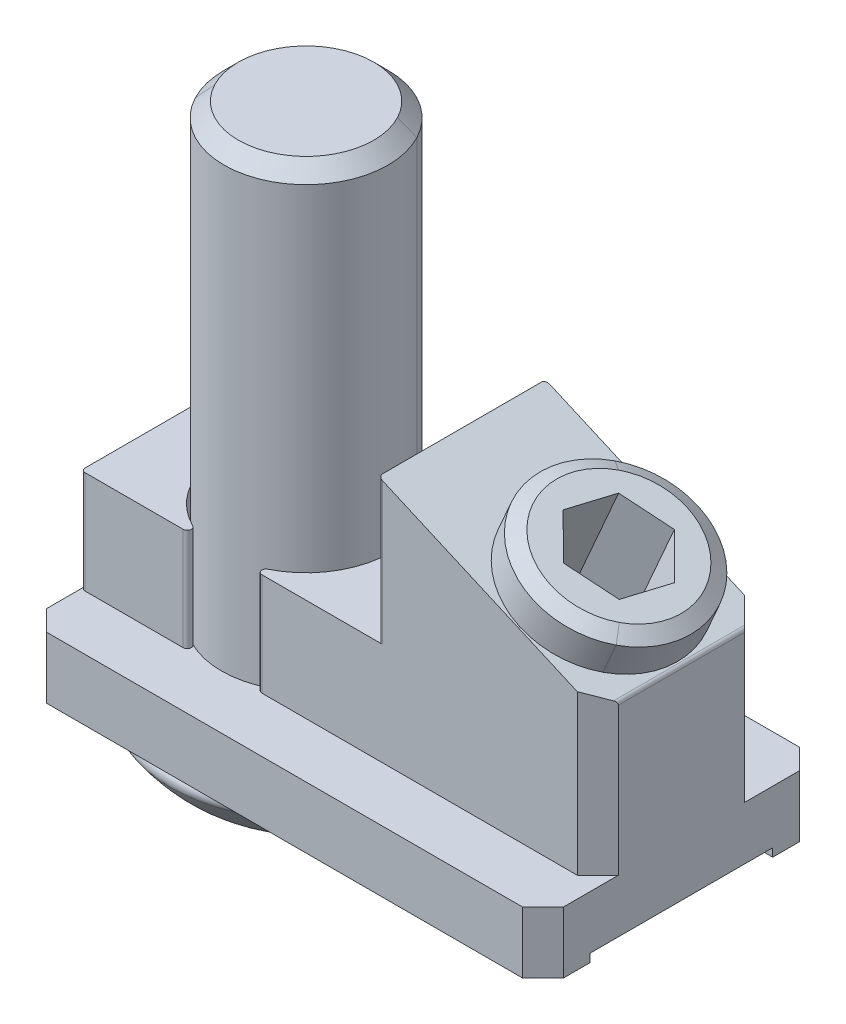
ISO-10303-21;
HEADER;
FILE_DESCRIPTION(('STEP AP214'),'2;1');
FILE_NAME('part.step','',(''),(''),'','','');
FILE_SCHEMA(('AUTOMOTIVE_DESIGN { 1 0 10303 214 1 1 1 1 }'));
ENDSEC;
DATA;
#1=APPLICATION_CONTEXT('core data for automotive mechanical design processes');
#2=APPLICATION_PROTOCOL_DEFINITION('international standard','automotive_design',2000,#1);
#3=PRODUCT_CONTEXT('',#1,'mechanical');
#4=PRODUCT('Part','Part','',(#3));
#5=PRODUCT_RELATED_PRODUCT_CATEGORY('part','',(#4));
#6=PRODUCT_DEFINITION_FORMATION('','',#4);
#7=PRODUCT_DEFINITION_CONTEXT('part definition',#1,'design');
#8=PRODUCT_DEFINITION('design','',#6,#7);
#9=PRODUCT_DEFINITION_SHAPE('','',#8);
#10=(LENGTH_UNIT() NAMED_UNIT(*) SI_UNIT(.MILLI.,.METRE.));
#11=(NAMED_UNIT(*) PLANE_ANGLE_UNIT() SI_UNIT($,.RADIAN.));
#12=(NAMED_UNIT(*) SI_UNIT($,.STERADIAN.) SOLID_ANGLE_UNIT());
#13=UNCERTAINTY_MEASURE_WITH_UNIT(LENGTH_MEASURE(1.E-05),#10,'distance_accuracy_value','');
#14=(GEOMETRIC_REPRESENTATION_CONTEXT(3) GLOBAL_UNCERTAINTY_ASSIGNED_CONTEXT((#13)) GLOBAL_UNIT_ASSIGNED_CONTEXT((#10,
#11,#12)) REPRESENTATION_CONTEXT('',''));
#15=CARTESIAN_POINT('',(0.,0.,0.));
#16=DIRECTION('',(0.,0.,1.));
#17=DIRECTION('',(1.,0.,0.));
#18=AXIS2_PLACEMENT_3D('',#15,#16,#17);
#19=CARTESIAN_POINT('',(10.9,10.1831201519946,0.));
#20=DIRECTION('',(0.,0.,-1.));
#21=DIRECTION('',(-1.,0.,0.));
#22=AXIS2_PLACEMENT_3D('',#19,#20,#21);
#23=CYLINDRICAL_SURFACE('',#22,0.2);
#24=CARTESIAN_POINT('',(10.9802339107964,10.3663209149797,-3.1947660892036));
#25=CARTESIAN_POINT('',(11.0552112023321,10.3334841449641,-3.11978879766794));
#26=CARTESIAN_POINT('',(11.1,10.2649727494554,-3.075));
#27=CARTESIAN_POINT('',(11.1,10.1831201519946,-3.075));
#28=(BOUNDED_CURVE() B_SPLINE_CURVE(3,(#24,#25,#26,#27),.UNSPECIFIED.,.F.,
.F.) B_SPLINE_CURVE_WITH_KNOTS((4,4),(1.98358961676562,3.1415926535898),
.UNSPECIFIED.) CURVE() GEOMETRIC_REPRESENTATION_ITEM() RATIONAL_B_SPLINE_CURVE((1.,
0.891339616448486,0.891339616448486,1.)) REPRESENTATION_ITEM(''));
#29=CARTESIAN_POINT('',(10.9802339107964,10.3663209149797,-3.1947660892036));
#30=VERTEX_POINT('',#29);
#31=CARTESIAN_POINT('',(11.1,10.1831201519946,-3.075));
#32=VERTEX_POINT('',#31);
#33=EDGE_CURVE('P0_E321',#30,#32,#28,.T.);
#34=ORIENTED_EDGE('',*,*,#33,.F.);
#35=DIRECTION('',(0.,0.,-1.));
#36=VECTOR('',#35,1.);
#37=CARTESIAN_POINT('',(10.9802339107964,10.3663209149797,-3.075));
#38=LINE('',#37,#36);
#39=CARTESIAN_POINT('',(10.9802339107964,10.3663209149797,3.19476608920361));
#40=VERTEX_POINT('',#39);
#41=EDGE_CURVE('P0_E646',#40,#30,#38,.T.);
#42=ORIENTED_EDGE('',*,*,#41,.F.);
#43=CARTESIAN_POINT('',(11.1,10.1831201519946,3.075));
#44=CARTESIAN_POINT('',(11.1,10.2649727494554,3.075));
#45=CARTESIAN_POINT('',(11.0552112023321,10.3334841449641,3.11978879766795));
#46=CARTESIAN_POINT('',(10.9802339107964,10.3663209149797,3.19476608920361));
#47=(BOUNDED_CURVE() B_SPLINE_CURVE(3,(#43,#44,#45,#46),.UNSPECIFIED.,.F.,
.F.) B_SPLINE_CURVE_WITH_KNOTS((4,4),(0.,1.15800303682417),
.UNSPECIFIED.) CURVE() GEOMETRIC_REPRESENTATION_ITEM() RATIONAL_B_SPLINE_CURVE((1.,
0.891339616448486,0.891339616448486,1.)) REPRESENTATION_ITEM(''));
#48=CARTESIAN_POINT('',(11.1,10.1831201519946,3.075));
#49=VERTEX_POINT('',#48);
#50=EDGE_CURVE('P0_E25',#49,#40,#47,.T.);
#51=ORIENTED_EDGE('',*,*,#50,.F.);
#52=DIRECTION('',(0.,0.,1.));
#53=VECTOR('',#52,1.);
#54=CARTESIAN_POINT('',(11.1,10.1831201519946,3.075));
#55=LINE('',#54,#53);
#56=EDGE_CURVE('P0_E541',#32,#49,#55,.T.);
#57=ORIENTED_EDGE('',*,*,#56,.F.);
#58=EDGE_LOOP('',(#34,#42,#51,#57));
#59=FACE_BOUND('',#58,.T.);
#60=ADVANCED_FACE('P0_F16',(#59),#23,.T.);
#61=CARTESIAN_POINT('',(-13.9,3.,-3.875));
#62=DIRECTION('',(0.,1.,0.));
#63=DIRECTION('',(1.,0.,0.));
#64=AXIS2_PLACEMENT_3D('',#61,#62,#63);
#65=PLANE('',#64);
#66=DIRECTION('',(0.707106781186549,0.,0.707106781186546));
#67=VECTOR('',#66,1.);
#68=CARTESIAN_POINT('',(10.1,3.,-4.075));
#69=LINE('',#68,#67);
#70=CARTESIAN_POINT('',(10.1,3.,-4.075));
#71=VERTEX_POINT('',#70);
#72=CARTESIAN_POINT('',(11.1,3.,-3.075));
#73=VERTEX_POINT('',#72);
#74=EDGE_CURVE('P0_E311',#71,#73,#69,.T.);
#75=ORIENTED_EDGE('',*,*,#74,.T.);
#76=DIRECTION('',(0.,0.,-1.));
#77=VECTOR('',#76,1.);
#78=CARTESIAN_POINT('',(11.1,3.,-3.075));
#79=LINE('',#78,#77);
#80=CARTESIAN_POINT('',(11.1,3.,-5.75));
#81=VERTEX_POINT('',#80);
#82=EDGE_CURVE('P0_E465',#73,#81,#79,.T.);
#83=ORIENTED_EDGE('',*,*,#82,.T.);
#84=DIRECTION('',(-0.707106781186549,0.,-0.707106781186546));
#85=VECTOR('',#84,1.);
#86=CARTESIAN_POINT('',(11.1,3.,-5.75));
#87=LINE('',#86,#85);
#88=CARTESIAN_POINT('',(10.1,3.,-6.75));
#89=VERTEX_POINT('',#88);
#90=EDGE_CURVE('P0_E551',#81,#89,#87,.T.);
#91=ORIENTED_EDGE('',*,*,#90,.T.);
#92=DIRECTION('',(-1.,0.,0.));
#93=VECTOR('',#92,1.);
#94=CARTESIAN_POINT('',(10.1,3.,-6.75));
#95=LINE('',#94,#93);
#96=CARTESIAN_POINT('',(-13.1,3.,-6.75));
#97=VERTEX_POINT('',#96);
#98=EDGE_CURVE('P0_E560',#89,#97,#95,.T.);
#99=ORIENTED_EDGE('',*,*,#98,.T.);
#100=DIRECTION('',(-0.707106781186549,0.,0.707106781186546));
#101=VECTOR('',#100,1.);
#102=CARTESIAN_POINT('',(-13.1,3.,-6.75));
#103=LINE('',#102,#101);
#104=CARTESIAN_POINT('',(-14.1,3.,-5.75));
#105=VERTEX_POINT('',#104);
#106=EDGE_CURVE('P0_E471',#97,#105,#103,.T.);
#107=ORIENTED_EDGE('',*,*,#106,.T.);
#108=DIRECTION('',(0.,0.,1.));
#109=VECTOR('',#108,1.);
#110=CARTESIAN_POINT('',(-14.1,3.,-5.75));
#111=LINE('',#110,#109);
#112=CARTESIAN_POINT('',(-14.1,3.,-3.875));
#113=VERTEX_POINT('',#112);
#114=EDGE_CURVE('P0_E638',#105,#113,#111,.T.);
#115=ORIENTED_EDGE('',*,*,#114,.T.);
#116=CARTESIAN_POINT('',(-13.9,3.,-3.875));
#117=DIRECTION('',(0.,-1.,0.));
#118=DIRECTION('',(0.,0.,1.));
#119=AXIS2_PLACEMENT_3D('',#116,#117,#118);
#120=CIRCLE('',#119,0.2);
#121=CARTESIAN_POINT('',(-13.9,3.,-4.075));
#122=VERTEX_POINT('',#121);
#123=EDGE_CURVE('P0_E565',#113,#122,#120,.T.);
#124=ORIENTED_EDGE('',*,*,#123,.T.);
#125=DIRECTION('',(1.,0.,0.));
#126=VECTOR('',#125,1.);
#127=CARTESIAN_POINT('',(-13.9,3.,-4.075));
#128=LINE('',#127,#126);
#129=CARTESIAN_POINT('',(-9.12093727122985,3.,-4.075));
#130=VERTEX_POINT('',#129);
#131=EDGE_CURVE('P0_E602',#122,#130,#128,.T.);
#132=ORIENTED_EDGE('',*,*,#131,.T.);
#133=CARTESIAN_POINT('',(-9.12093727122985,3.,-3.875));
#134=DIRECTION('',(0.,-1.,0.));
#135=DIRECTION('',(0.,0.,1.));
#136=AXIS2_PLACEMENT_3D('',#133,#134,#135);
#137=CIRCLE('',#136,0.2);
#138=CARTESIAN_POINT('',(-9.03210780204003,3.,-3.69580924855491));
#139=VERTEX_POINT('',#138);
#140=EDGE_CURVE('P0_E796',#130,#139,#137,.T.);
#141=ORIENTED_EDGE('',*,*,#140,.T.);
#142=CARTESIAN_POINT('',(-7.2,3.,0.));
#143=DIRECTION('',(0.,-1.,0.));
#144=DIRECTION('',(0.,0.,1.));
#145=AXIS2_PLACEMENT_3D('',#142,#143,#144);
#146=CIRCLE('',#145,4.125);
#147=CARTESIAN_POINT('',(-5.36789219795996,3.,-3.69580924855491));
#148=VERTEX_POINT('',#147);
#149=EDGE_CURVE('P0_E402',#139,#148,#146,.T.);
#150=ORIENTED_EDGE('',*,*,#149,.T.);
#151=CARTESIAN_POINT('',(-5.27906272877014,3.,-3.875));
#152=DIRECTION('',(0.,-1.,0.));
#153=DIRECTION('',(0.,0.,1.));
#154=AXIS2_PLACEMENT_3D('',#151,#152,#153);
#155=CIRCLE('',#154,0.2);
#156=CARTESIAN_POINT('',(-5.47906272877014,3.,-3.875));
#157=VERTEX_POINT('',#156);
#158=EDGE_CURVE('P0_E568',#148,#157,#155,.T.);
#159=ORIENTED_EDGE('',*,*,#158,.T.);
#160=CARTESIAN_POINT('',(-5.27906272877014,3.,-3.875));
#161=DIRECTION('',(0.,-1.,0.));
#162=DIRECTION('',(0.,0.,1.));
#163=AXIS2_PLACEMENT_3D('',#160,#161,#162);
#164=CIRCLE('',#163,0.2);
#165=CARTESIAN_POINT('',(-5.27906272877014,3.,-4.075));
#166=VERTEX_POINT('',#165);
#167=EDGE_CURVE('P0_E378',#157,#166,#164,.T.);
#168=ORIENTED_EDGE('',*,*,#167,.T.);
#169=DIRECTION('',(1.,0.,0.));
#170=VECTOR('',#169,1.);
#171=CARTESIAN_POINT('',(-5.27906272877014,3.,-4.075));
#172=LINE('',#171,#170);
#173=EDGE_CURVE('P0_E634',#166,#71,#172,.T.);
#174=ORIENTED_EDGE('',*,*,#173,.T.);
#175=EDGE_LOOP('',(#75,#83,#91,#99,#107,#115,#124,#132,#141,#150,#159,#168,#174));
#176=FACE_BOUND('',#175,.T.);
#177=ADVANCED_FACE('P0_F840',(#176),#65,.T.);
#178=CARTESIAN_POINT('',(-5.27906272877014,3.,3.875));
#179=DIRECTION('',(0.,1.,0.));
#180=DIRECTION('',(1.,0.,0.));
#181=AXIS2_PLACEMENT_3D('',#178,#179,#180);
#182=PLANE('',#181);
#183=DIRECTION('',(0.707106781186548,0.,0.707106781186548));
#184=VECTOR('',#183,1.);
#185=CARTESIAN_POINT('',(-14.1,3.,5.75));
#186=LINE('',#185,#184);
#187=CARTESIAN_POINT('',(-14.1,3.,5.75));
#188=VERTEX_POINT('',#187);
#189=CARTESIAN_POINT('',(-13.1,3.,6.75));
#190=VERTEX_POINT('',#189);
#191=EDGE_CURVE('P0_E664',#188,#190,#186,.T.);
#192=ORIENTED_EDGE('',*,*,#191,.T.);
#193=DIRECTION('',(1.,0.,0.));
#194=VECTOR('',#193,1.);
#195=CARTESIAN_POINT('',(-13.1,3.,6.75));
#196=LINE('',#195,#194);
#197=CARTESIAN_POINT('',(10.1,3.,6.75));
#198=VERTEX_POINT('',#197);
#199=EDGE_CURVE('P0_E489',#190,#198,#196,.T.);
#200=ORIENTED_EDGE('',*,*,#199,.T.);
#201=DIRECTION('',(0.707106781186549,0.,-0.707106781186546));
#202=VECTOR('',#201,1.);
#203=CARTESIAN_POINT('',(10.1,3.,6.75));
#204=LINE('',#203,#202);
#205=CARTESIAN_POINT('',(11.1,3.,5.75));
#206=VERTEX_POINT('',#205);
#207=EDGE_CURVE('P0_E689',#198,#206,#204,.T.);
#208=ORIENTED_EDGE('',*,*,#207,.T.);
#209=DIRECTION('',(0.,0.,-1.));
#210=VECTOR('',#209,1.);
#211=CARTESIAN_POINT('',(11.1,3.,5.75));
#212=LINE('',#211,#210);
#213=CARTESIAN_POINT('',(11.1,3.,3.075));
#214=VERTEX_POINT('',#213);
#215=EDGE_CURVE('P0_E462',#206,#214,#212,.T.);
#216=ORIENTED_EDGE('',*,*,#215,.T.);
#217=DIRECTION('',(-0.707106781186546,0.,0.707106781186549));
#218=VECTOR('',#217,1.);
#219=CARTESIAN_POINT('',(11.1,3.,3.075));
#220=LINE('',#219,#218);
#221=CARTESIAN_POINT('',(10.1,3.,4.075));
#222=VERTEX_POINT('',#221);
#223=EDGE_CURVE('P0_E10',#214,#222,#220,.T.);
#224=ORIENTED_EDGE('',*,*,#223,.T.);
#225=DIRECTION('',(-1.,0.,0.));
#226=VECTOR('',#225,1.);
#227=CARTESIAN_POINT('',(10.1,3.,4.075));
#228=LINE('',#227,#226);
#229=CARTESIAN_POINT('',(-5.27906272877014,3.,4.075));
#230=VERTEX_POINT('',#229);
#231=EDGE_CURVE('P0_E514',#222,#230,#228,.T.);
#232=ORIENTED_EDGE('',*,*,#231,.T.);
#233=CARTESIAN_POINT('',(-5.27906272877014,3.,3.875));
#234=DIRECTION('',(0.,-1.,0.));
#235=DIRECTION('',(0.,0.,1.));
#236=AXIS2_PLACEMENT_3D('',#233,#234,#235);
#237=CIRCLE('',#236,0.2);
#238=CARTESIAN_POINT('',(-5.47906272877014,3.,3.875));
#239=VERTEX_POINT('',#238);
#240=EDGE_CURVE('P0_E482',#230,#239,#237,.T.);
#241=ORIENTED_EDGE('',*,*,#240,.T.);
#242=CARTESIAN_POINT('',(-5.27906272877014,3.,3.875));
#243=DIRECTION('',(0.,-1.,0.));
#244=DIRECTION('',(0.,0.,1.));
#245=AXIS2_PLACEMENT_3D('',#242,#243,#244);
#246=CIRCLE('',#245,0.2);
#247=CARTESIAN_POINT('',(-5.36789219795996,3.,3.69580924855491));
#248=VERTEX_POINT('',#247);
#249=EDGE_CURVE('P0_E427',#239,#248,#246,.T.);
#250=ORIENTED_EDGE('',*,*,#249,.T.);
#251=CARTESIAN_POINT('',(-7.2,3.,0.));
#252=DIRECTION('',(0.,-1.,0.));
#253=DIRECTION('',(0.,0.,1.));
#254=AXIS2_PLACEMENT_3D('',#251,#252,#253);
#255=CIRCLE('',#254,4.125);
#256=CARTESIAN_POINT('',(-9.03210780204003,3.,3.69580924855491));
#257=VERTEX_POINT('',#256);
#258=EDGE_CURVE('P0_E532',#248,#257,#255,.T.);
#259=ORIENTED_EDGE('',*,*,#258,.T.);
#260=CARTESIAN_POINT('',(-9.12093727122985,3.,3.875));
#261=DIRECTION('',(0.,-1.,0.));
#262=DIRECTION('',(0.,0.,1.));
#263=AXIS2_PLACEMENT_3D('',#260,#261,#262);
#264=CIRCLE('',#263,0.2);
#265=CARTESIAN_POINT('',(-9.12093727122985,3.,4.075));
#266=VERTEX_POINT('',#265);
#267=EDGE_CURVE('P0_E479',#257,#266,#264,.T.);
#268=ORIENTED_EDGE('',*,*,#267,.T.);
#269=DIRECTION('',(-1.,0.,0.));
#270=VECTOR('',#269,1.);
#271=CARTESIAN_POINT('',(-9.12093727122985,3.,4.075));
#272=LINE('',#271,#270);
#273=CARTESIAN_POINT('',(-13.9,3.,4.075));
#274=VERTEX_POINT('',#273);
#275=EDGE_CURVE('P0_E404',#266,#274,#272,.T.);
#276=ORIENTED_EDGE('',*,*,#275,.T.);
#277=CARTESIAN_POINT('',(-13.9,3.,3.875));
#278=DIRECTION('',(0.,-1.,0.));
#279=DIRECTION('',(0.,0.,1.));
#280=AXIS2_PLACEMENT_3D('',#277,#278,#279);
#281=CIRCLE('',#280,0.2);
#282=CARTESIAN_POINT('',(-14.1,3.,3.875));
#283=VERTEX_POINT('',#282);
#284=EDGE_CURVE('P0_E564',#274,#283,#281,.T.);
#285=ORIENTED_EDGE('',*,*,#284,.T.);
#286=DIRECTION('',(0.,0.,1.));
#287=VECTOR('',#286,1.);
#288=CARTESIAN_POINT('',(-14.1,3.,3.875));
#289=LINE('',#288,#287);
#290=EDGE_CURVE('P0_E618',#283,#188,#289,.T.);
#291=ORIENTED_EDGE('',*,*,#290,.T.);
#292=EDGE_LOOP('',(#192,#200,#208,#216,#224,#232,#241,#250,#259,#268,#276,#285,#291));
#293=FACE_BOUND('',#292,.T.);
#294=ADVANCED_FACE('P0_F832',(#293),#182,.T.);
#295=CARTESIAN_POINT('',(10.1,0.,4.075));
#296=DIRECTION('',(-0.707106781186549,0.,-0.707106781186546));
#297=DIRECTION('',(-0.707106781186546,0.,0.707106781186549));
#298=AXIS2_PLACEMENT_3D('',#295,#296,#297);
#299=PLANE('',#298);
#300=DIRECTION('',(0.,-1.,0.));
#301=VECTOR('',#300,1.);
#302=CARTESIAN_POINT('',(11.1,0.,3.075));
#303=LINE('',#302,#301);
#304=EDGE_CURVE('P0_E466',#49,#214,#303,.T.);
#305=ORIENTED_EDGE('',*,*,#304,.F.);
#306=ORIENTED_EDGE('',*,*,#50,.T.);
#307=DIRECTION('',(0.675458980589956,-0.295821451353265,-0.675458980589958));
#308=VECTOR('',#307,1.);
#309=CARTESIAN_POINT('',(12.2483786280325,9.81092906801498,1.92662137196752));
#310=LINE('',#309,#308);
#311=CARTESIAN_POINT('',(10.1,10.7518248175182,4.075));
#312=VERTEX_POINT('',#311);
#313=EDGE_CURVE('P0_E369',#312,#40,#310,.T.);
#314=ORIENTED_EDGE('',*,*,#313,.F.);
#315=DIRECTION('',(0.,1.,0.));
#316=VECTOR('',#315,1.);
#317=CARTESIAN_POINT('',(10.1,0.,4.075));
#318=LINE('',#317,#316);
#319=EDGE_CURVE('P0_E518',#222,#312,#318,.T.);
#320=ORIENTED_EDGE('',*,*,#319,.F.);
#321=ORIENTED_EDGE('',*,*,#223,.F.);
#322=EDGE_LOOP('',(#305,#306,#314,#320,#321));
#323=FACE_BOUND('',#322,.T.);
#324=ADVANCED_FACE('P0_F819',(#323),#299,.F.);
#325=CARTESIAN_POINT('',(11.1,0.,-3.075));
#326=DIRECTION('',(0.707106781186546,0.,-0.707106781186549));
#327=DIRECTION('',(0.,-1.,0.));
#328=AXIS2_PLACEMENT_3D('',#325,#326,#327);
#329=PLANE('',#328);
#330=DIRECTION('',(-0.675458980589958,0.295821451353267,-0.675458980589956));
#331=VECTOR('',#330,1.);
#332=CARTESIAN_POINT('',(13.1608682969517,9.41129855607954,-1.01413170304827));
#333=LINE('',#332,#331);
#334=CARTESIAN_POINT('',(10.1,10.7518248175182,-4.075));
#335=VERTEX_POINT('',#334);
#336=EDGE_CURVE('P0_E750',#30,#335,#333,.T.);
#337=ORIENTED_EDGE('',*,*,#336,.F.);
#338=ORIENTED_EDGE('',*,*,#33,.T.);
#339=DIRECTION('',(0.,1.,0.));
#340=VECTOR('',#339,1.);
#341=CARTESIAN_POINT('',(11.1,10.3138686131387,-3.075));
#342=LINE('',#341,#340);
#343=EDGE_CURVE('P0_E545',#73,#32,#342,.T.);
#344=ORIENTED_EDGE('',*,*,#343,.F.);
#345=ORIENTED_EDGE('',*,*,#74,.F.);
#346=DIRECTION('',(0.,-1.,0.));
#347=VECTOR('',#346,1.);
#348=CARTESIAN_POINT('',(10.1,4.,-4.075));
#349=LINE('',#348,#347);
#350=EDGE_CURVE('P0_E685',#335,#71,#349,.T.);
#351=ORIENTED_EDGE('',*,*,#350,.F.);
#352=EDGE_LOOP('',(#337,#338,#344,#345,#351));
#353=FACE_BOUND('',#352,.T.);
#354=ADVANCED_FACE('P0_F837',(#353),#329,.T.);
#355=CARTESIAN_POINT('',(11.1,0.,0.));
#356=DIRECTION('',(1.,0.,0.));
#357=DIRECTION('',(0.,1.,0.));
#358=AXIS2_PLACEMENT_3D('',#355,#356,#357);
#359=PLANE('',#358);
#360=ORIENTED_EDGE('',*,*,#343,.T.);
#361=ORIENTED_EDGE('',*,*,#56,.T.);
#362=ORIENTED_EDGE('',*,*,#304,.T.);
#363=ORIENTED_EDGE('',*,*,#215,.F.);
#364=DIRECTION('',(0.,-1.,0.));
#365=VECTOR('',#364,1.);
#366=CARTESIAN_POINT('',(11.1,0.,5.75));
#367=LINE('',#366,#365);
#368=CARTESIAN_POINT('',(11.1,0.,5.75));
#369=VERTEX_POINT('',#368);
#370=EDGE_CURVE('P0_E681',#206,#369,#367,.T.);
#371=ORIENTED_EDGE('',*,*,#370,.T.);
#372=DIRECTION('',(0.,0.,1.));
#373=VECTOR('',#372,1.);
#374=CARTESIAN_POINT('',(11.1,0.,0.));
#375=LINE('',#374,#373);
#376=CARTESIAN_POINT('',(11.1,0.,4.45));
#377=VERTEX_POINT('',#376);
#378=EDGE_CURVE('P0_E580',#377,#369,#375,.T.);
#379=ORIENTED_EDGE('',*,*,#378,.F.);
#380=DIRECTION('',(0.,1.,0.));
#381=VECTOR('',#380,1.);
#382=CARTESIAN_POINT('',(11.1,0.4,4.45));
#383=LINE('',#382,#381);
#384=CARTESIAN_POINT('',(11.1,0.4,4.45));
#385=VERTEX_POINT('',#384);
#386=EDGE_CURVE('P0_E497',#377,#385,#383,.T.);
#387=ORIENTED_EDGE('',*,*,#386,.T.);
#388=DIRECTION('',(0.,0.,1.));
#389=VECTOR('',#388,1.);
#390=CARTESIAN_POINT('',(11.1,0.4,0.));
#391=LINE('',#390,#389);
#392=CARTESIAN_POINT('',(11.1,0.4,-4.45));
#393=VERTEX_POINT('',#392);
#394=EDGE_CURVE('P0_E675',#393,#385,#391,.T.);
#395=ORIENTED_EDGE('',*,*,#394,.F.);
#396=DIRECTION('',(0.,-1.,0.));
#397=VECTOR('',#396,1.);
#398=CARTESIAN_POINT('',(11.1,0.4,-4.45));
#399=LINE('',#398,#397);
#400=CARTESIAN_POINT('',(11.1,0.,-4.45));
#401=VERTEX_POINT('',#400);
#402=EDGE_CURVE('P0_E524',#393,#401,#399,.T.);
#403=ORIENTED_EDGE('',*,*,#402,.T.);
#404=DIRECTION('',(0.,0.,1.));
#405=VECTOR('',#404,1.);
#406=CARTESIAN_POINT('',(11.1,0.,0.));
#407=LINE('',#406,#405);
#408=CARTESIAN_POINT('',(11.1,0.,-5.75));
#409=VERTEX_POINT('',#408);
#410=EDGE_CURVE('P0_E730',#409,#401,#407,.T.);
#411=ORIENTED_EDGE('',*,*,#410,.F.);
#412=DIRECTION('',(0.,1.,0.));
#413=VECTOR('',#412,1.);
#414=CARTESIAN_POINT('',(11.1,4.,-5.75));
#415=LINE('',#414,#413);
#416=EDGE_CURVE('P0_E546',#409,#81,#415,.T.);
#417=ORIENTED_EDGE('',*,*,#416,.T.);
#418=ORIENTED_EDGE('',*,*,#82,.F.);
#419=EDGE_LOOP('',(#360,#361,#362,#363,#371,#379,#387,#395,#403,#411,#417,#418));
#420=FACE_BOUND('',#419,.T.);
#421=ADVANCED_FACE('P0_F836',(#420),#359,.T.);
#422=CARTESIAN_POINT('',(8.2,0.4,4.45));
#423=DIRECTION('',(-1.,0.,0.));
#424=DIRECTION('',(0.,0.,1.));
#425=AXIS2_PLACEMENT_3D('',#422,#423,#424);
#426=PLANE('',#425);
#427=DIRECTION('',(0.,0.,-1.));
#428=VECTOR('',#427,1.);
#429=CARTESIAN_POINT('',(8.2,0.,4.45));
#430=LINE('',#429,#428);
#431=CARTESIAN_POINT('',(8.2,0.,4.45));
#432=VERTEX_POINT('',#431);
#433=CARTESIAN_POINT('',(8.2,0.,-4.45));
#434=VERTEX_POINT('',#433);
#435=EDGE_CURVE('P0_E740',#432,#434,#430,.T.);
#436=ORIENTED_EDGE('',*,*,#435,.T.);
#437=DIRECTION('',(0.,-1.,0.));
#438=VECTOR('',#437,1.);
#439=CARTESIAN_POINT('',(8.2,0.4,-4.45));
#440=LINE('',#439,#438);
#441=CARTESIAN_POINT('',(8.2,0.4,-4.45));
#442=VERTEX_POINT('',#441);
#443=EDGE_CURVE('P0_E501',#442,#434,#440,.T.);
#444=ORIENTED_EDGE('',*,*,#443,.F.);
#445=DIRECTION('',(0.,0.,-1.));
#446=VECTOR('',#445,1.);
#447=CARTESIAN_POINT('',(8.2,0.4,4.45));
#448=LINE('',#447,#446);
#449=CARTESIAN_POINT('',(8.2,0.4,4.45));
#450=VERTEX_POINT('',#449);
#451=EDGE_CURVE('P0_E690',#450,#442,#448,.T.);
#452=ORIENTED_EDGE('',*,*,#451,.F.);
#453=DIRECTION('',(0.,-1.,0.));
#454=VECTOR('',#453,1.);
#455=CARTESIAN_POINT('',(8.2,0.4,4.45));
#456=LINE('',#455,#454);
#457=EDGE_CURVE('P0_E493',#450,#432,#456,.T.);
#458=ORIENTED_EDGE('',*,*,#457,.T.);
#459=EDGE_LOOP('',(#436,#444,#452,#458));
#460=FACE_BOUND('',#459,.T.);
#461=ADVANCED_FACE('P0_F1478',(#460),#426,.F.);
#462=CARTESIAN_POINT('',(-13.9,0.,3.875));
#463=DIRECTION('',(0.,1.,0.));
#464=DIRECTION('',(0.,0.,1.));
#465=AXIS2_PLACEMENT_3D('',#462,#463,#464);
#466=CYLINDRICAL_SURFACE('',#465,0.2);
#467=CARTESIAN_POINT('',(-13.9,8.,3.875));
#468=DIRECTION('',(0.,1.,0.));
#469=DIRECTION('',(1.,0.,0.));
#470=AXIS2_PLACEMENT_3D('',#467,#468,#469);
#471=CIRCLE('',#470,0.2);
#472=CARTESIAN_POINT('',(-14.1,8.,3.875));
#473=VERTEX_POINT('',#472);
#474=CARTESIAN_POINT('',(-13.9,8.,4.075));
#475=VERTEX_POINT('',#474);
#476=EDGE_CURVE('P0_E442',#473,#475,#471,.T.);
#477=ORIENTED_EDGE('',*,*,#476,.F.);
#478=DIRECTION('',(0.,1.,0.));
#479=VECTOR('',#478,1.);
#480=CARTESIAN_POINT('',(-14.1,8.,3.875));
#481=LINE('',#480,#479);
#482=EDGE_CURVE('P0_E613',#283,#473,#481,.T.);
#483=ORIENTED_EDGE('',*,*,#482,.F.);
#484=ORIENTED_EDGE('',*,*,#284,.F.);
#485=DIRECTION('',(0.,-1.,0.));
#486=VECTOR('',#485,1.);
#487=CARTESIAN_POINT('',(-13.9,4.,4.075));
#488=LINE('',#487,#486);
#489=EDGE_CURVE('P0_E409',#475,#274,#488,.T.);
#490=ORIENTED_EDGE('',*,*,#489,.F.);
#491=EDGE_LOOP('',(#477,#483,#484,#490));
#492=FACE_BOUND('',#491,.T.);
#493=ADVANCED_FACE('P0_F879',(#492),#466,.T.);
#494=CARTESIAN_POINT('',(-13.9,4.,-3.875));
#495=DIRECTION('',(0.,-1.,0.));
#496=DIRECTION('',(0.,0.,-1.));
#497=AXIS2_PLACEMENT_3D('',#494,#495,#496);
#498=CYLINDRICAL_SURFACE('',#497,0.2);
#499=CARTESIAN_POINT('',(-13.9,8.,-3.875));
#500=DIRECTION('',(0.,1.,0.));
#501=DIRECTION('',(1.,0.,0.));
#502=AXIS2_PLACEMENT_3D('',#499,#500,#501);
#503=CIRCLE('',#502,0.2);
#504=CARTESIAN_POINT('',(-13.9,8.,-4.075));
#505=VERTEX_POINT('',#504);
#506=CARTESIAN_POINT('',(-14.1,8.,-3.875));
#507=VERTEX_POINT('',#506);
#508=EDGE_CURVE('P0_E671',#505,#507,#503,.T.);
#509=ORIENTED_EDGE('',*,*,#508,.F.);
#510=DIRECTION('',(0.,1.,0.));
#511=VECTOR('',#510,1.);
#512=CARTESIAN_POINT('',(-13.9,0.,-4.075));
#513=LINE('',#512,#511);
#514=EDGE_CURVE('P0_E483',#122,#505,#513,.T.);
#515=ORIENTED_EDGE('',*,*,#514,.F.);
#516=ORIENTED_EDGE('',*,*,#123,.F.);
#517=DIRECTION('',(0.,-1.,0.));
#518=VECTOR('',#517,1.);
#519=CARTESIAN_POINT('',(-14.1,4.,-3.875));
#520=LINE('',#519,#518);
#521=EDGE_CURVE('P0_E631',#507,#113,#520,.T.);
#522=ORIENTED_EDGE('',*,*,#521,.F.);
#523=EDGE_LOOP('',(#509,#515,#516,#522));
#524=FACE_BOUND('',#523,.T.);
#525=ADVANCED_FACE('P0_F929',(#524),#498,.T.);
#526=CARTESIAN_POINT('',(0.6,0.,3.875));
#527=DIRECTION('',(0.,1.,0.));
#528=DIRECTION('',(-1.,0.,0.));
#529=AXIS2_PLACEMENT_3D('',#526,#527,#528);
#530=CYLINDRICAL_SURFACE('',#529,0.2);
#531=CARTESIAN_POINT('',(0.4,15.,3.875));
#532=CARTESIAN_POINT('',(0.400000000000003,15.,3.99215728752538));
#533=CARTESIAN_POINT('',(0.482842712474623,14.9637185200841,4.07500000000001));
#534=CARTESIAN_POINT('',(0.6,14.9124087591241,4.075));
#535=(BOUNDED_CURVE() B_SPLINE_CURVE(3,(#531,#532,#533,#534),.UNSPECIFIED.,.F.,
.F.) B_SPLINE_CURVE_WITH_KNOTS((4,4),(0.,1.57079632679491),
.UNSPECIFIED.) CURVE() GEOMETRIC_REPRESENTATION_ITEM() RATIONAL_B_SPLINE_CURVE((1.,
0.804737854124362,0.804737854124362,1.)) REPRESENTATION_ITEM(''));
#536=CARTESIAN_POINT('',(0.4,15.,3.875));
#537=VERTEX_POINT('',#536);
#538=CARTESIAN_POINT('',(0.6,14.9124087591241,4.075));
#539=VERTEX_POINT('',#538);
#540=EDGE_CURVE('P0_E700',#537,#539,#535,.T.);
#541=ORIENTED_EDGE('',*,*,#540,.F.);
#542=DIRECTION('',(0.,1.,0.));
#543=VECTOR('',#542,1.);
#544=CARTESIAN_POINT('',(0.4,15.,3.875));
#545=LINE('',#544,#543);
#546=CARTESIAN_POINT('',(0.4,8.,3.875));
#547=VERTEX_POINT('',#546);
#548=EDGE_CURVE('P0_E596',#547,#537,#545,.T.);
#549=ORIENTED_EDGE('',*,*,#548,.F.);
#550=CARTESIAN_POINT('',(0.6,8.,3.875));
#551=DIRECTION('',(0.,-1.,0.));
#552=DIRECTION('',(1.,0.,0.));
#553=AXIS2_PLACEMENT_3D('',#550,#551,#552);
#554=CIRCLE('',#553,0.2);
#555=CARTESIAN_POINT('',(0.6,8.,4.075));
#556=VERTEX_POINT('',#555);
#557=EDGE_CURVE('P0_E449',#556,#547,#554,.T.);
#558=ORIENTED_EDGE('',*,*,#557,.F.);
#559=DIRECTION('',(0.,-1.,0.));
#560=VECTOR('',#559,1.);
#561=CARTESIAN_POINT('',(0.6,8.,4.075));
#562=LINE('',#561,#560);
#563=EDGE_CURVE('P0_E458',#539,#556,#562,.T.);
#564=ORIENTED_EDGE('',*,*,#563,.F.);
#565=EDGE_LOOP('',(#541,#549,#558,#564));
#566=FACE_BOUND('',#565,.T.);
#567=ADVANCED_FACE('P0_F854',(#566),#530,.T.);
#568=CARTESIAN_POINT('',(0.6,15.,-3.875));
#569=DIRECTION('',(0.,-1.,0.));
#570=DIRECTION('',(1.,0.,0.));
#571=AXIS2_PLACEMENT_3D('',#568,#569,#570);
#572=CYLINDRICAL_SURFACE('',#571,0.2);
#573=CARTESIAN_POINT('',(0.6,14.9124087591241,-4.075));
#574=CARTESIAN_POINT('',(0.482842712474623,14.9637185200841,-4.075));
#575=CARTESIAN_POINT('',(0.400000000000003,15.,-3.99215728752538));
#576=CARTESIAN_POINT('',(0.4,15.,-3.875));
#577=(BOUNDED_CURVE() B_SPLINE_CURVE(3,(#573,#574,#575,#576),.UNSPECIFIED.,.F.,
.F.) B_SPLINE_CURVE_WITH_KNOTS((4,4),(1.57079632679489,3.1415926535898),
.UNSPECIFIED.) CURVE() GEOMETRIC_REPRESENTATION_ITEM() RATIONAL_B_SPLINE_CURVE((1.,
0.804737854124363,0.804737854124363,1.)) REPRESENTATION_ITEM(''));
#578=CARTESIAN_POINT('',(0.6,14.9124087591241,-4.075));
#579=VERTEX_POINT('',#578);
#580=CARTESIAN_POINT('',(0.4,15.,-3.875));
#581=VERTEX_POINT('',#580);
#582=EDGE_CURVE('P0_E753',#579,#581,#577,.T.);
#583=ORIENTED_EDGE('',*,*,#582,.F.);
#584=DIRECTION('',(0.,1.,0.));
#585=VECTOR('',#584,1.);
#586=CARTESIAN_POINT('',(0.6,0.,-4.075));
#587=LINE('',#586,#585);
#588=CARTESIAN_POINT('',(0.6,8.,-4.075));
#589=VERTEX_POINT('',#588);
#590=EDGE_CURVE('P0_E576',#589,#579,#587,.T.);
#591=ORIENTED_EDGE('',*,*,#590,.F.);
#592=CARTESIAN_POINT('',(0.6,8.,-3.875));
#593=DIRECTION('',(0.,-1.,0.));
#594=DIRECTION('',(1.,0.,0.));
#595=AXIS2_PLACEMENT_3D('',#592,#593,#594);
#596=CIRCLE('',#595,0.2);
#597=CARTESIAN_POINT('',(0.4,8.,-3.875));
#598=VERTEX_POINT('',#597);
#599=EDGE_CURVE('P0_E446',#598,#589,#596,.T.);
#600=ORIENTED_EDGE('',*,*,#599,.F.);
#601=DIRECTION('',(0.,-1.,0.));
#602=VECTOR('',#601,1.);
#603=CARTESIAN_POINT('',(0.4,15.,-3.875));
#604=LINE('',#603,#602);
#605=EDGE_CURVE('P0_E597',#581,#598,#604,.T.);
#606=ORIENTED_EDGE('',*,*,#605,.F.);
#607=EDGE_LOOP('',(#583,#591,#600,#606));
#608=FACE_BOUND('',#607,.T.);
#609=ADVANCED_FACE('P0_F848',(#608),#572,.T.);
#610=CARTESIAN_POINT('',(7.25,12.,0.));
#611=DIRECTION('',(0.401169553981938,0.916003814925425,0.));
#612=DIRECTION('',(-0.916003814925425,0.401169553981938,0.));
#613=AXIS2_PLACEMENT_3D('',#610,#611,#612);
#614=CYLINDRICAL_SURFACE('',#613,3.4);
#615=DIRECTION('',(0.401169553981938,0.916003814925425,0.));
#616=VECTOR('',#615,1.);
#617=CARTESIAN_POINT('',(10.3644129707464,10.6360235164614,0.));
#618=LINE('',#617,#616);
#619=CARTESIAN_POINT('',(5.70630048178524,0.,0.));
#620=VERTEX_POINT('',#619);
#621=CARTESIAN_POINT('',(10.3644129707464,10.6360235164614,0.));
#622=VERTEX_POINT('',#621);
#623=EDGE_CURVE('P0_E364',#620,#622,#618,.T.);
#624=ORIENTED_EDGE('',*,*,#623,.F.);
#625=CARTESIAN_POINT('',(5.70630048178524,0.,0.));
#626=CARTESIAN_POINT('',(5.70630048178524,0.,6.79999999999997));
#627=CARTESIAN_POINT('',(-1.71724938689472,0.,6.79999999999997));
#628=CARTESIAN_POINT('',(-1.71724938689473,0.,0.));
#629=(BOUNDED_CURVE() B_SPLINE_CURVE(3,(#625,#626,#627,#628),.UNSPECIFIED.,.F.,
.F.) B_SPLINE_CURVE_WITH_KNOTS((4,4),(0.,3.1415926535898),
.UNSPECIFIED.) CURVE() GEOMETRIC_REPRESENTATION_ITEM() RATIONAL_B_SPLINE_CURVE((1.,
0.333333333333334,0.333333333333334,1.)) REPRESENTATION_ITEM(''));
#630=CARTESIAN_POINT('',(-1.71724938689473,0.,0.));
#631=VERTEX_POINT('',#630);
#632=EDGE_CURVE('P0_E358',#620,#631,#629,.T.);
#633=ORIENTED_EDGE('',*,*,#632,.T.);
#634=DIRECTION('',(0.401169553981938,0.916003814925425,0.));
#635=VECTOR('',#634,1.);
#636=CARTESIAN_POINT('',(4.13558702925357,13.3639764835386,0.));
#637=LINE('',#636,#635);
#638=CARTESIAN_POINT('',(4.13558702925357,13.3639764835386,0.));
#639=VERTEX_POINT('',#638);
#640=EDGE_CURVE('P0_E361',#631,#639,#637,.T.);
#641=ORIENTED_EDGE('',*,*,#640,.T.);
#642=CARTESIAN_POINT('',(7.25,12.,0.));
#643=DIRECTION('',(0.401169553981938,0.916003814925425,0.));
#644=DIRECTION('',(-0.916003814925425,0.401169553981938,0.));
#645=AXIS2_PLACEMENT_3D('',#642,#643,#644);
#646=CIRCLE('',#645,3.4);
#647=EDGE_CURVE('P0_E528',#639,#622,#646,.T.);
#648=ORIENTED_EDGE('',*,*,#647,.T.);
#649=EDGE_LOOP('',(#624,#633,#641,#648));
#650=FACE_BOUND('',#649,.T.);
#651=ADVANCED_FACE('P0_F360',(#650),#614,.F.);
#652=CARTESIAN_POINT('',(-5.27906272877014,0.,-3.875));
#653=DIRECTION('',(0.,1.,0.));
#654=DIRECTION('',(-1.,0.,0.));
#655=AXIS2_PLACEMENT_3D('',#652,#653,#654);
#656=CYLINDRICAL_SURFACE('',#655,0.2);
#657=DIRECTION('',(0.,1.,0.));
#658=VECTOR('',#657,1.);
#659=CARTESIAN_POINT('',(-5.47906272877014,0.,-3.875));
#660=LINE('',#659,#658);
#661=CARTESIAN_POINT('',(-5.47906272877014,8.,-3.875));
#662=VERTEX_POINT('',#661);
#663=EDGE_CURVE('P0_E433',#157,#662,#660,.T.);
#664=ORIENTED_EDGE('',*,*,#663,.F.);
#665=ORIENTED_EDGE('',*,*,#158,.F.);
#666=DIRECTION('',(0.,-1.,0.));
#667=VECTOR('',#666,1.);
#668=CARTESIAN_POINT('',(-5.36789219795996,0.,-3.69580924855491));
#669=LINE('',#668,#667);
#670=CARTESIAN_POINT('',(-5.36789219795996,8.,-3.69580924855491));
#671=VERTEX_POINT('',#670);
#672=EDGE_CURVE('P0_E395',#671,#148,#669,.T.);
#673=ORIENTED_EDGE('',*,*,#672,.F.);
#674=CARTESIAN_POINT('',(-5.27906272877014,8.,-3.875));
#675=DIRECTION('',(0.,1.,0.));
#676=DIRECTION('',(1.,0.,0.));
#677=AXIS2_PLACEMENT_3D('',#674,#675,#676);
#678=CIRCLE('',#677,0.2);
#679=EDGE_CURVE('P0_E421',#662,#671,#678,.T.);
#680=ORIENTED_EDGE('',*,*,#679,.F.);
#681=EDGE_LOOP('',(#664,#665,#673,#680));
#682=FACE_BOUND('',#681,.T.);
#683=ADVANCED_FACE('P0_F949',(#682),#656,.T.);
#684=CARTESIAN_POINT('',(-9.12093727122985,0.,-3.875));
#685=DIRECTION('',(0.,1.,0.));
#686=DIRECTION('',(-1.,0.,0.));
#687=AXIS2_PLACEMENT_3D('',#684,#685,#686);
#688=CYLINDRICAL_SURFACE('',#687,0.2);
#689=CARTESIAN_POINT('',(-9.12093727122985,8.,-3.875));
#690=DIRECTION('',(0.,1.,0.));
#691=DIRECTION('',(1.,0.,0.));
#692=AXIS2_PLACEMENT_3D('',#689,#690,#691);
#693=CIRCLE('',#692,0.2);
#694=CARTESIAN_POINT('',(-9.03210780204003,8.,-3.69580924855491));
#695=VERTEX_POINT('',#694);
#696=CARTESIAN_POINT('',(-9.12093727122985,8.,-4.075));
#697=VERTEX_POINT('',#696);
#698=EDGE_CURVE('P0_E667',#695,#697,#693,.T.);
#699=ORIENTED_EDGE('',*,*,#698,.F.);
#700=DIRECTION('',(0.,1.,0.));
#701=VECTOR('',#700,1.);
#702=CARTESIAN_POINT('',(-9.03210780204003,0.,-3.69580924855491));
#703=LINE('',#702,#701);
#704=EDGE_CURVE('P0_E505',#139,#695,#703,.T.);
#705=ORIENTED_EDGE('',*,*,#704,.F.);
#706=ORIENTED_EDGE('',*,*,#140,.F.);
#707=DIRECTION('',(0.,-1.,0.));
#708=VECTOR('',#707,1.);
#709=CARTESIAN_POINT('',(-9.12093727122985,0.,-4.075));
#710=LINE('',#709,#708);
#711=EDGE_CURVE('P0_E557',#697,#130,#710,.T.);
#712=ORIENTED_EDGE('',*,*,#711,.F.);
#713=EDGE_LOOP('',(#699,#705,#706,#712));
#714=FACE_BOUND('',#713,.T.);
#715=ADVANCED_FACE('P0_F934',(#714),#688,.T.);
#716=CARTESIAN_POINT('',(-5.27906272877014,0.,3.875));
#717=DIRECTION('',(0.,1.,0.));
#718=DIRECTION('',(-1.,0.,0.));
#719=AXIS2_PLACEMENT_3D('',#716,#717,#718);
#720=CYLINDRICAL_SURFACE('',#719,0.2);
#721=DIRECTION('',(0.,1.,0.));
#722=VECTOR('',#721,1.);
#723=CARTESIAN_POINT('',(-5.47906272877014,0.,3.875));
#724=LINE('',#723,#722);
#725=CARTESIAN_POINT('',(-5.47906272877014,8.,3.875));
#726=VERTEX_POINT('',#725);
#727=EDGE_CURVE('P0_E422',#239,#726,#724,.T.);
#728=ORIENTED_EDGE('',*,*,#727,.F.);
#729=ORIENTED_EDGE('',*,*,#240,.F.);
#730=DIRECTION('',(0.,-1.,0.));
#731=VECTOR('',#730,1.);
#732=CARTESIAN_POINT('',(-5.27906272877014,4.,4.075));
#733=LINE('',#732,#731);
#734=CARTESIAN_POINT('',(-5.27906272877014,8.,4.075));
#735=VERTEX_POINT('',#734);
#736=EDGE_CURVE('P0_E519',#735,#230,#733,.T.);
#737=ORIENTED_EDGE('',*,*,#736,.F.);
#738=CARTESIAN_POINT('',(-5.27906272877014,8.,3.875));
#739=DIRECTION('',(0.,1.,0.));
#740=DIRECTION('',(1.,0.,0.));
#741=AXIS2_PLACEMENT_3D('',#738,#739,#740);
#742=CIRCLE('',#741,0.2);
#743=EDGE_CURVE('P0_E722',#726,#735,#742,.T.);
#744=ORIENTED_EDGE('',*,*,#743,.F.);
#745=EDGE_LOOP('',(#728,#729,#737,#744));
#746=FACE_BOUND('',#745,.T.);
#747=ADVANCED_FACE('P0_F858',(#746),#720,.T.);
#748=CARTESIAN_POINT('',(-9.12093727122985,0.,3.875));
#749=DIRECTION('',(0.,1.,0.));
#750=DIRECTION('',(-1.,0.,0.));
#751=AXIS2_PLACEMENT_3D('',#748,#749,#750);
#752=CYLINDRICAL_SURFACE('',#751,0.2);
#753=CARTESIAN_POINT('',(-9.12093727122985,8.,3.875));
#754=DIRECTION('',(0.,1.,0.));
#755=DIRECTION('',(1.,0.,0.));
#756=AXIS2_PLACEMENT_3D('',#753,#754,#755);
#757=CIRCLE('',#756,0.2);
#758=CARTESIAN_POINT('',(-9.12093727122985,8.,4.075));
#759=VERTEX_POINT('',#758);
#760=CARTESIAN_POINT('',(-9.03210780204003,8.,3.69580924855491));
#761=VERTEX_POINT('',#760);
#762=EDGE_CURVE('P0_E441',#759,#761,#757,.T.);
#763=ORIENTED_EDGE('',*,*,#762,.F.);
#764=DIRECTION('',(0.,1.,0.));
#765=VECTOR('',#764,1.);
#766=CARTESIAN_POINT('',(-9.12093727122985,8.,4.075));
#767=LINE('',#766,#765);
#768=EDGE_CURVE('P0_E408',#266,#759,#767,.T.);
#769=ORIENTED_EDGE('',*,*,#768,.F.);
#770=ORIENTED_EDGE('',*,*,#267,.F.);
#771=DIRECTION('',(0.,-1.,0.));
#772=VECTOR('',#771,1.);
#773=CARTESIAN_POINT('',(-9.03210780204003,0.,3.69580924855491));
#774=LINE('',#773,#772);
#775=EDGE_CURVE('P0_E537',#761,#257,#774,.T.);
#776=ORIENTED_EDGE('',*,*,#775,.F.);
#777=EDGE_LOOP('',(#763,#769,#770,#776));
#778=FACE_BOUND('',#777,.T.);
#779=ADVANCED_FACE('P0_F871',(#778),#752,.T.);
#780=CARTESIAN_POINT('',(0.,0.,-4.075));
#781=DIRECTION('',(0.,0.,1.));
#782=DIRECTION('',(1.,0.,0.));
#783=AXIS2_PLACEMENT_3D('',#780,#781,#782);
#784=PLANE('',#783);
#785=ORIENTED_EDGE('',*,*,#711,.T.);
#786=ORIENTED_EDGE('',*,*,#131,.F.);
#787=ORIENTED_EDGE('',*,*,#514,.T.);
#788=DIRECTION('',(-1.,0.,0.));
#789=VECTOR('',#788,1.);
#790=CARTESIAN_POINT('',(0.4,8.,-4.075));
#791=LINE('',#790,#789);
#792=EDGE_CURVE('P0_E693',#697,#505,#791,.T.);
#793=ORIENTED_EDGE('',*,*,#792,.F.);
#794=EDGE_LOOP('',(#785,#786,#787,#793));
#795=FACE_BOUND('',#794,.T.);
#796=ADVANCED_FACE('P0_F932',(#795),#784,.F.);
#797=CARTESIAN_POINT('',(0.,0.,4.075));
#798=DIRECTION('',(0.,0.,1.));
#799=DIRECTION('',(1.,0.,0.));
#800=AXIS2_PLACEMENT_3D('',#797,#798,#799);
#801=PLANE('',#800);
#802=DIRECTION('',(-1.,0.,0.));
#803=VECTOR('',#802,1.);
#804=CARTESIAN_POINT('',(0.4,8.,4.075));
#805=LINE('',#804,#803);
#806=EDGE_CURVE('P0_E437',#759,#475,#805,.T.);
#807=ORIENTED_EDGE('',*,*,#806,.T.);
#808=ORIENTED_EDGE('',*,*,#489,.T.);
#809=ORIENTED_EDGE('',*,*,#275,.F.);
#810=ORIENTED_EDGE('',*,*,#768,.T.);
#811=EDGE_LOOP('',(#807,#808,#809,#810));
#812=FACE_BOUND('',#811,.T.);
#813=ADVANCED_FACE('P0_F875',(#812),#801,.T.);
#814=CARTESIAN_POINT('',(0.4,8.,4.075));
#815=DIRECTION('',(0.,-1.,0.));
#816=DIRECTION('',(0.,0.,-1.));
#817=AXIS2_PLACEMENT_3D('',#814,#815,#816);
#818=PLANE('',#817);
#819=CARTESIAN_POINT('',(-7.2,8.,0.));
#820=DIRECTION('',(0.,1.,0.));
#821=DIRECTION('',(-1.,0.,0.));
#822=AXIS2_PLACEMENT_3D('',#819,#820,#821);
#823=CIRCLE('',#822,4.125);
#824=CARTESIAN_POINT('',(-5.36789219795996,8.,3.69580924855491));
#825=VERTEX_POINT('',#824);
#826=CARTESIAN_POINT('',(-3.075,8.,0.));
#827=VERTEX_POINT('',#826);
#828=EDGE_CURVE('P0_E536',#825,#827,#823,.T.);
#829=ORIENTED_EDGE('',*,*,#828,.F.);
#830=CARTESIAN_POINT('',(-5.27906272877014,8.,3.875));
#831=DIRECTION('',(0.,1.,0.));
#832=DIRECTION('',(1.,0.,0.));
#833=AXIS2_PLACEMENT_3D('',#830,#831,#832);
#834=CIRCLE('',#833,0.2);
#835=EDGE_CURVE('P0_E426',#825,#726,#834,.T.);
#836=ORIENTED_EDGE('',*,*,#835,.T.);
#837=ORIENTED_EDGE('',*,*,#743,.T.);
#838=DIRECTION('',(-1.,0.,0.));
#839=VECTOR('',#838,1.);
#840=CARTESIAN_POINT('',(0.4,8.,4.075));
#841=LINE('',#840,#839);
#842=EDGE_CURVE('P0_E453',#556,#735,#841,.T.);
#843=ORIENTED_EDGE('',*,*,#842,.F.);
#844=ORIENTED_EDGE('',*,*,#557,.T.);
#845=DIRECTION('',(0.,0.,-1.));
#846=VECTOR('',#845,1.);
#847=CARTESIAN_POINT('',(0.4,8.,4.075));
#848=LINE('',#847,#846);
#849=EDGE_CURVE('P0_E592',#547,#598,#848,.T.);
#850=ORIENTED_EDGE('',*,*,#849,.T.);
#851=ORIENTED_EDGE('',*,*,#599,.T.);
#852=DIRECTION('',(-1.,0.,0.));
#853=VECTOR('',#852,1.);
#854=CARTESIAN_POINT('',(0.4,8.,-4.075));
#855=LINE('',#854,#853);
#856=CARTESIAN_POINT('',(-5.27906272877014,8.,-4.075));
#857=VERTEX_POINT('',#856);
#858=EDGE_CURVE('P0_E581',#589,#857,#855,.T.);
#859=ORIENTED_EDGE('',*,*,#858,.T.);
#860=CARTESIAN_POINT('',(-5.27906272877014,8.,-3.875));
#861=DIRECTION('',(0.,1.,0.));
#862=DIRECTION('',(1.,0.,0.));
#863=AXIS2_PLACEMENT_3D('',#860,#861,#862);
#864=CIRCLE('',#863,0.2);
#865=EDGE_CURVE('P0_E428',#857,#662,#864,.T.);
#866=ORIENTED_EDGE('',*,*,#865,.T.);
#867=ORIENTED_EDGE('',*,*,#679,.T.);
#868=CARTESIAN_POINT('',(-7.2,8.,0.));
#869=DIRECTION('',(0.,1.,0.));
#870=DIRECTION('',(-1.,0.,0.));
#871=AXIS2_PLACEMENT_3D('',#868,#869,#870);
#872=CIRCLE('',#871,4.125);
#873=EDGE_CURVE('P0_E403',#827,#671,#872,.T.);
#874=ORIENTED_EDGE('',*,*,#873,.F.);
#875=EDGE_LOOP('',(#829,#836,#837,#843,#844,#850,#851,#859,#866,#867,#874));
#876=FACE_BOUND('',#875,.T.);
#877=ADVANCED_FACE('P0_F953',(#876),#818,.F.);
#878=CARTESIAN_POINT('',(0.4,15.,4.075));
#879=DIRECTION('',(1.,0.,0.));
#880=DIRECTION('',(0.,1.,0.));
#881=AXIS2_PLACEMENT_3D('',#878,#879,#880);
#882=PLANE('',#881);
#883=DIRECTION('',(0.,0.,-1.));
#884=VECTOR('',#883,1.);
#885=CARTESIAN_POINT('',(0.4,15.,4.075));
#886=LINE('',#885,#884);
#887=EDGE_CURVE('P0_E705',#537,#581,#886,.T.);
#888=ORIENTED_EDGE('',*,*,#887,.T.);
#889=ORIENTED_EDGE('',*,*,#605,.T.);
#890=ORIENTED_EDGE('',*,*,#849,.F.);
#891=ORIENTED_EDGE('',*,*,#548,.T.);
#892=EDGE_LOOP('',(#888,#889,#890,#891));
#893=FACE_BOUND('',#892,.T.);
#894=ADVANCED_FACE('P0_F851',(#893),#882,.F.);
#895=CARTESIAN_POINT('',(0.4,8.,4.075));
#896=DIRECTION('',(0.,-1.,0.));
#897=DIRECTION('',(0.,0.,-1.));
#898=AXIS2_PLACEMENT_3D('',#895,#896,#897);
#899=PLANE('',#898);
#900=ORIENTED_EDGE('',*,*,#792,.T.);
#901=ORIENTED_EDGE('',*,*,#508,.T.);
#902=DIRECTION('',(0.,0.,-1.));
#903=VECTOR('',#902,1.);
#904=CARTESIAN_POINT('',(-14.1,8.,4.075));
#905=LINE('',#904,#903);
#906=EDGE_CURVE('P0_E617',#473,#507,#905,.T.);
#907=ORIENTED_EDGE('',*,*,#906,.F.);
#908=ORIENTED_EDGE('',*,*,#476,.T.);
#909=ORIENTED_EDGE('',*,*,#806,.F.);
#910=ORIENTED_EDGE('',*,*,#762,.T.);
#911=CARTESIAN_POINT('',(-7.2,8.,0.));
#912=DIRECTION('',(0.,1.,0.));
#913=DIRECTION('',(-1.,0.,0.));
#914=AXIS2_PLACEMENT_3D('',#911,#912,#913);
#915=CIRCLE('',#914,4.125);
#916=CARTESIAN_POINT('',(-11.325,8.,0.));
#917=VERTEX_POINT('',#916);
#918=EDGE_CURVE('P0_E531',#917,#761,#915,.T.);
#919=ORIENTED_EDGE('',*,*,#918,.F.);
#920=CARTESIAN_POINT('',(-7.2,8.,0.));
#921=DIRECTION('',(0.,1.,0.));
#922=DIRECTION('',(-1.,0.,0.));
#923=AXIS2_PLACEMENT_3D('',#920,#921,#922);
#924=CIRCLE('',#923,4.125);
#925=EDGE_CURVE('P0_E509',#695,#917,#924,.T.);
#926=ORIENTED_EDGE('',*,*,#925,.F.);
#927=ORIENTED_EDGE('',*,*,#698,.T.);
#928=EDGE_LOOP('',(#900,#901,#907,#908,#909,#910,#919,#926,#927));
#929=FACE_BOUND('',#928,.T.);
#930=ADVANCED_FACE('P0_F938',(#929),#899,.F.);
#931=CARTESIAN_POINT('',(0.,0.4,0.));
#932=DIRECTION('',(0.,-1.,0.));
#933=DIRECTION('',(0.,0.,-1.));
#934=AXIS2_PLACEMENT_3D('',#931,#932,#933);
#935=PLANE('',#934);
#936=DIRECTION('',(1.,0.,0.));
#937=VECTOR('',#936,1.);
#938=CARTESIAN_POINT('',(8.2,0.4,-4.45));
#939=LINE('',#938,#937);
#940=EDGE_CURVE('P0_E527',#442,#393,#939,.T.);
#941=ORIENTED_EDGE('',*,*,#940,.T.);
#942=ORIENTED_EDGE('',*,*,#394,.T.);
#943=DIRECTION('',(-1.,0.,0.));
#944=VECTOR('',#943,1.);
#945=CARTESIAN_POINT('',(8.2,0.4,4.45));
#946=LINE('',#945,#944);
#947=EDGE_CURVE('P0_E496',#385,#450,#946,.T.);
#948=ORIENTED_EDGE('',*,*,#947,.T.);
#949=ORIENTED_EDGE('',*,*,#451,.T.);
#950=EDGE_LOOP('',(#941,#942,#948,#949));
#951=FACE_BOUND('',#950,.T.);
#952=ADVANCED_FACE('P0_F904',(#951),#935,.T.);
#953=CARTESIAN_POINT('',(8.2,0.4,4.45));
#954=DIRECTION('',(0.,0.,1.));
#955=DIRECTION('',(1.,0.,0.));
#956=AXIS2_PLACEMENT_3D('',#953,#954,#955);
#957=PLANE('',#956);
#958=ORIENTED_EDGE('',*,*,#386,.F.);
#959=DIRECTION('',(-1.,0.,0.));
#960=VECTOR('',#959,1.);
#961=CARTESIAN_POINT('',(8.2,0.,4.45));
#962=LINE('',#961,#960);
#963=EDGE_CURVE('P0_E370',#377,#432,#962,.T.);
#964=ORIENTED_EDGE('',*,*,#963,.T.);
#965=ORIENTED_EDGE('',*,*,#457,.F.);
#966=ORIENTED_EDGE('',*,*,#947,.F.);
#967=EDGE_LOOP('',(#958,#964,#965,#966));
#968=FACE_BOUND('',#967,.T.);
#969=ADVANCED_FACE('P0_F901',(#968),#957,.F.);
#970=CARTESIAN_POINT('',(8.2,0.4,-4.45));
#971=DIRECTION('',(0.,0.,-1.));
#972=DIRECTION('',(-1.,0.,0.));
#973=AXIS2_PLACEMENT_3D('',#970,#971,#972);
#974=PLANE('',#973);
#975=ORIENTED_EDGE('',*,*,#402,.F.);
#976=ORIENTED_EDGE('',*,*,#940,.F.);
#977=ORIENTED_EDGE('',*,*,#443,.T.);
#978=DIRECTION('',(1.,0.,0.));
#979=VECTOR('',#978,1.);
#980=CARTESIAN_POINT('',(8.2,0.,-4.45));
#981=LINE('',#980,#979);
#982=EDGE_CURVE('P0_E734',#434,#401,#981,.T.);
#983=ORIENTED_EDGE('',*,*,#982,.T.);
#984=EDGE_LOOP('',(#975,#976,#977,#983));
#985=FACE_BOUND('',#984,.T.);
#986=ADVANCED_FACE('P0_F909',(#985),#974,.F.);
#987=CARTESIAN_POINT('',(14.1,9.,4.075));
#988=DIRECTION('',(-0.401169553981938,-0.916003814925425,0.));
#989=DIRECTION('',(-0.916003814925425,0.401169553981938,0.));
#990=AXIS2_PLACEMENT_3D('',#987,#988,#989);
#991=PLANE('',#990);
#992=ORIENTED_EDGE('',*,*,#647,.F.);
#993=CARTESIAN_POINT('',(7.25,12.,0.));
#994=DIRECTION('',(0.401169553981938,0.916003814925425,0.));
#995=DIRECTION('',(-0.916003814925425,0.401169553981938,0.));
#996=AXIS2_PLACEMENT_3D('',#993,#994,#995);
#997=CIRCLE('',#996,3.4);
#998=EDGE_CURVE('P0_E376',#622,#639,#997,.T.);
#999=ORIENTED_EDGE('',*,*,#998,.F.);
#1000=EDGE_LOOP('',(#992,#999));
#1001=FACE_BOUND('',#1000,.T.);
#1002=ORIENTED_EDGE('',*,*,#313,.T.);
#1003=ORIENTED_EDGE('',*,*,#41,.T.);
#1004=ORIENTED_EDGE('',*,*,#336,.T.);
#1005=DIRECTION('',(-0.916003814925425,0.401169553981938,0.));
#1006=VECTOR('',#1005,1.);
#1007=CARTESIAN_POINT('',(14.1,9.,-4.075));
#1008=LINE('',#1007,#1006);
#1009=EDGE_CURVE('P0_E457',#335,#579,#1008,.T.);
#1010=ORIENTED_EDGE('',*,*,#1009,.T.);
#1011=ORIENTED_EDGE('',*,*,#582,.T.);
#1012=ORIENTED_EDGE('',*,*,#887,.F.);
#1013=ORIENTED_EDGE('',*,*,#540,.T.);
#1014=DIRECTION('',(-0.916003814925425,0.401169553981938,0.));
#1015=VECTOR('',#1014,1.);
#1016=CARTESIAN_POINT('',(14.1,9.,4.075));
#1017=LINE('',#1016,#1015);
#1018=EDGE_CURVE('P0_E654',#312,#539,#1017,.T.);
#1019=ORIENTED_EDGE('',*,*,#1018,.F.);
#1020=EDGE_LOOP('',(#1002,#1003,#1004,#1010,#1011,#1012,#1013,#1019));
#1021=FACE_BOUND('',#1020,.T.);
#1022=ADVANCED_FACE('P0_F823',(#1001,#1021),#991,.F.);
#1023=CARTESIAN_POINT('',(0.,0.,0.));
#1024=DIRECTION('',(0.,-1.,0.));
#1025=DIRECTION('',(0.,0.,-1.));
#1026=AXIS2_PLACEMENT_3D('',#1023,#1024,#1025);
#1027=PLANE('',#1026);
#1028=CARTESIAN_POINT('',(-7.2,0.,0.));
#1029=DIRECTION('',(0.,1.,0.));
#1030=DIRECTION('',(-1.,0.,0.));
#1031=AXIS2_PLACEMENT_3D('',#1028,#1029,#1030);
#1032=CIRCLE('',#1031,4.125);
#1033=CARTESIAN_POINT('',(-11.325,0.,0.));
#1034=VERTEX_POINT('',#1033);
#1035=CARTESIAN_POINT('',(-3.075,0.,0.));
#1036=VERTEX_POINT('',#1035);
#1037=EDGE_CURVE('P0_E523',#1034,#1036,#1032,.T.);
#1038=ORIENTED_EDGE('',*,*,#1037,.T.);
#1039=CARTESIAN_POINT('',(-7.2,0.,0.));
#1040=DIRECTION('',(0.,1.,0.));
#1041=DIRECTION('',(-1.,0.,0.));
#1042=AXIS2_PLACEMENT_3D('',#1039,#1040,#1041);
#1043=CIRCLE('',#1042,4.125);
#1044=EDGE_CURVE('P0_E410',#1036,#1034,#1043,.T.);
#1045=ORIENTED_EDGE('',*,*,#1044,.T.);
#1046=EDGE_LOOP('',(#1038,#1045));
#1047=FACE_BOUND('',#1046,.T.);
#1048=CARTESIAN_POINT('',(-1.71724938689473,0.,0.));
#1049=CARTESIAN_POINT('',(-1.71724938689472,0.,-6.79999999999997));
#1050=CARTESIAN_POINT('',(5.70630048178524,0.,-6.79999999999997));
#1051=CARTESIAN_POINT('',(5.70630048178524,0.,0.));
#1052=(BOUNDED_CURVE() B_SPLINE_CURVE(3,(#1048,#1049,#1050,#1051),.UNSPECIFIED.,.F.,
.F.) B_SPLINE_CURVE_WITH_KNOTS((4,4),(3.1415926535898,6.28318530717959),
.UNSPECIFIED.) CURVE() GEOMETRIC_REPRESENTATION_ITEM() RATIONAL_B_SPLINE_CURVE((1.,
0.333333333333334,0.333333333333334,1.)) REPRESENTATION_ITEM(''));
#1053=EDGE_CURVE('P0_E374',#631,#620,#1052,.T.);
#1054=ORIENTED_EDGE('',*,*,#1053,.F.);
#1055=ORIENTED_EDGE('',*,*,#632,.F.);
#1056=EDGE_LOOP('',(#1054,#1055));
#1057=FACE_BOUND('',#1056,.T.);
#1058=ORIENTED_EDGE('',*,*,#378,.T.);
#1059=DIRECTION('',(-0.707106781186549,0.,0.707106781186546));
#1060=VECTOR('',#1059,1.);
#1061=CARTESIAN_POINT('',(8.425,0.,8.425));
#1062=LINE('',#1061,#1060);
#1063=CARTESIAN_POINT('',(10.1,0.,6.75));
#1064=VERTEX_POINT('',#1063);
#1065=EDGE_CURVE('P0_E697',#369,#1064,#1062,.T.);
#1066=ORIENTED_EDGE('',*,*,#1065,.T.);
#1067=DIRECTION('',(1.,0.,0.));
#1068=VECTOR('',#1067,1.);
#1069=CARTESIAN_POINT('',(-14.1,0.,6.75));
#1070=LINE('',#1069,#1068);
#1071=CARTESIAN_POINT('',(-13.1,0.,6.75));
#1072=VERTEX_POINT('',#1071);
#1073=EDGE_CURVE('P0_E488',#1072,#1064,#1070,.T.);
#1074=ORIENTED_EDGE('',*,*,#1073,.F.);
#1075=DIRECTION('',(-0.707106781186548,0.,-0.707106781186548));
#1076=VECTOR('',#1075,1.);
#1077=CARTESIAN_POINT('',(-9.925,0.,9.925));
#1078=LINE('',#1077,#1076);
#1079=CARTESIAN_POINT('',(-14.1,0.,5.75));
#1080=VERTEX_POINT('',#1079);
#1081=EDGE_CURVE('P0_E678',#1072,#1080,#1078,.T.);
#1082=ORIENTED_EDGE('',*,*,#1081,.T.);
#1083=DIRECTION('',(0.,0.,1.));
#1084=VECTOR('',#1083,1.);
#1085=CARTESIAN_POINT('',(-14.1,0.,6.75));
#1086=LINE('',#1085,#1084);
#1087=CARTESIAN_POINT('',(-14.1,0.,-5.75));
#1088=VERTEX_POINT('',#1087);
#1089=EDGE_CURVE('P0_E642',#1088,#1080,#1086,.T.);
#1090=ORIENTED_EDGE('',*,*,#1089,.F.);
#1091=DIRECTION('',(0.707106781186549,0.,-0.707106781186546));
#1092=VECTOR('',#1091,1.);
#1093=CARTESIAN_POINT('',(-9.925,0.,-9.925));
#1094=LINE('',#1093,#1092);
#1095=CARTESIAN_POINT('',(-13.1,0.,-6.75));
#1096=VERTEX_POINT('',#1095);
#1097=EDGE_CURVE('P0_E601',#1088,#1096,#1094,.T.);
#1098=ORIENTED_EDGE('',*,*,#1097,.T.);
#1099=DIRECTION('',(-1.,0.,0.));
#1100=VECTOR('',#1099,1.);
#1101=CARTESIAN_POINT('',(-14.1,0.,-6.75));
#1102=LINE('',#1101,#1100);
#1103=CARTESIAN_POINT('',(10.1,0.,-6.75));
#1104=VERTEX_POINT('',#1103);
#1105=EDGE_CURVE('P0_E585',#1104,#1096,#1102,.T.);
#1106=ORIENTED_EDGE('',*,*,#1105,.F.);
#1107=DIRECTION('',(0.707106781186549,0.,0.707106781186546));
#1108=VECTOR('',#1107,1.);
#1109=CARTESIAN_POINT('',(8.425,0.,-8.425));
#1110=LINE('',#1109,#1108);
#1111=EDGE_CURVE('P0_E550',#1104,#409,#1110,.T.);
#1112=ORIENTED_EDGE('',*,*,#1111,.T.);
#1113=ORIENTED_EDGE('',*,*,#410,.T.);
#1114=ORIENTED_EDGE('',*,*,#982,.F.);
#1115=ORIENTED_EDGE('',*,*,#435,.F.);
#1116=ORIENTED_EDGE('',*,*,#963,.F.);
#1117=EDGE_LOOP('',(#1058,#1066,#1074,#1082,#1090,#1098,#1106,#1112,#1113,#1114,#1115,#1116));
#1118=FACE_BOUND('',#1117,.T.);
#1119=ADVANCED_FACE('P0_F380',(#1047,#1057,#1118),#1027,.T.);
#1120=CARTESIAN_POINT('',(0.,0.,-4.075));
#1121=DIRECTION('',(0.,0.,1.));
#1122=DIRECTION('',(1.,0.,0.));
#1123=AXIS2_PLACEMENT_3D('',#1120,#1121,#1122);
#1124=PLANE('',#1123);
#1125=ORIENTED_EDGE('',*,*,#1009,.F.);
#1126=ORIENTED_EDGE('',*,*,#350,.T.);
#1127=ORIENTED_EDGE('',*,*,#173,.F.);
#1128=DIRECTION('',(0.,1.,0.));
#1129=VECTOR('',#1128,1.);
#1130=CARTESIAN_POINT('',(-5.27906272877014,0.,-4.075));
#1131=LINE('',#1130,#1129);
#1132=EDGE_CURVE('P0_E432',#166,#857,#1131,.T.);
#1133=ORIENTED_EDGE('',*,*,#1132,.T.);
#1134=ORIENTED_EDGE('',*,*,#858,.F.);
#1135=ORIENTED_EDGE('',*,*,#590,.T.);
#1136=EDGE_LOOP('',(#1125,#1126,#1127,#1133,#1134,#1135));
#1137=FACE_BOUND('',#1136,.T.);
#1138=ADVANCED_FACE('P0_F844',(#1137),#1124,.F.);
#1139=CARTESIAN_POINT('',(0.,0.,4.075));
#1140=DIRECTION('',(0.,0.,1.));
#1141=DIRECTION('',(1.,0.,0.));
#1142=AXIS2_PLACEMENT_3D('',#1139,#1140,#1141);
#1143=PLANE('',#1142);
#1144=ORIENTED_EDGE('',*,*,#736,.T.);
#1145=ORIENTED_EDGE('',*,*,#231,.F.);
#1146=ORIENTED_EDGE('',*,*,#319,.T.);
#1147=ORIENTED_EDGE('',*,*,#1018,.T.);
#1148=ORIENTED_EDGE('',*,*,#563,.T.);
#1149=ORIENTED_EDGE('',*,*,#842,.T.);
#1150=EDGE_LOOP('',(#1144,#1145,#1146,#1147,#1148,#1149));
#1151=FACE_BOUND('',#1150,.T.);
#1152=ADVANCED_FACE('P0_F829',(#1151),#1143,.T.);
#1153=CARTESIAN_POINT('',(11.1,0.,5.75));
#1154=DIRECTION('',(0.707106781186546,0.,0.707106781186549));
#1155=DIRECTION('',(0.,-1.,0.));
#1156=AXIS2_PLACEMENT_3D('',#1153,#1154,#1155);
#1157=PLANE('',#1156);
#1158=ORIENTED_EDGE('',*,*,#370,.F.);
#1159=ORIENTED_EDGE('',*,*,#207,.F.);
#1160=DIRECTION('',(0.,1.,0.));
#1161=VECTOR('',#1160,1.);
#1162=CARTESIAN_POINT('',(10.1,4.,6.75));
#1163=LINE('',#1162,#1161);
#1164=EDGE_CURVE('P0_E627',#1064,#198,#1163,.T.);
#1165=ORIENTED_EDGE('',*,*,#1164,.F.);
#1166=ORIENTED_EDGE('',*,*,#1065,.F.);
#1167=EDGE_LOOP('',(#1158,#1159,#1165,#1166));
#1168=FACE_BOUND('',#1167,.T.);
#1169=ADVANCED_FACE('P0_F894',(#1168),#1157,.T.);
#1170=CARTESIAN_POINT('',(-13.1,4.,6.75));
#1171=DIRECTION('',(0.707106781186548,0.,-0.707106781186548));
#1172=DIRECTION('',(0.,-1.,0.));
#1173=AXIS2_PLACEMENT_3D('',#1170,#1171,#1172);
#1174=PLANE('',#1173);
#1175=DIRECTION('',(0.,-1.,0.));
#1176=VECTOR('',#1175,1.);
#1177=CARTESIAN_POINT('',(-13.1,4.,6.75));
#1178=LINE('',#1177,#1176);
#1179=EDGE_CURVE('P0_E484',#190,#1072,#1178,.T.);
#1180=ORIENTED_EDGE('',*,*,#1179,.F.);
#1181=ORIENTED_EDGE('',*,*,#191,.F.);
#1182=DIRECTION('',(0.,1.,0.));
#1183=VECTOR('',#1182,1.);
#1184=CARTESIAN_POINT('',(-14.1,4.,5.75));
#1185=LINE('',#1184,#1183);
#1186=EDGE_CURVE('P0_E650',#1080,#188,#1185,.T.);
#1187=ORIENTED_EDGE('',*,*,#1186,.F.);
#1188=ORIENTED_EDGE('',*,*,#1081,.F.);
#1189=EDGE_LOOP('',(#1180,#1181,#1187,#1188));
#1190=FACE_BOUND('',#1189,.T.);
#1191=ADVANCED_FACE('P0_F886',(#1190),#1174,.F.);
#1192=CARTESIAN_POINT('',(-14.1,4.,6.75));
#1193=DIRECTION('',(1.,0.,0.));
#1194=DIRECTION('',(0.,1.,0.));
#1195=AXIS2_PLACEMENT_3D('',#1192,#1193,#1194);
#1196=PLANE('',#1195);
#1197=ORIENTED_EDGE('',*,*,#521,.T.);
#1198=ORIENTED_EDGE('',*,*,#114,.F.);
#1199=DIRECTION('',(0.,-1.,0.));
#1200=VECTOR('',#1199,1.);
#1201=CARTESIAN_POINT('',(-14.1,4.,-5.75));
#1202=LINE('',#1201,#1200);
#1203=EDGE_CURVE('P0_E467',#105,#1088,#1202,.T.);
#1204=ORIENTED_EDGE('',*,*,#1203,.T.);
#1205=ORIENTED_EDGE('',*,*,#1089,.T.);
#1206=ORIENTED_EDGE('',*,*,#1186,.T.);
#1207=ORIENTED_EDGE('',*,*,#290,.F.);
#1208=ORIENTED_EDGE('',*,*,#482,.T.);
#1209=ORIENTED_EDGE('',*,*,#906,.T.);
#1210=EDGE_LOOP('',(#1197,#1198,#1204,#1205,#1206,#1207,#1208,#1209));
#1211=FACE_BOUND('',#1210,.T.);
#1212=ADVANCED_FACE('P0_F882',(#1211),#1196,.F.);
#1213=CARTESIAN_POINT('',(-14.1,4.,6.75));
#1214=DIRECTION('',(0.,0.,-1.));
#1215=DIRECTION('',(0.,-1.,0.));
#1216=AXIS2_PLACEMENT_3D('',#1213,#1214,#1215);
#1217=PLANE('',#1216);
#1218=ORIENTED_EDGE('',*,*,#199,.F.);
#1219=ORIENTED_EDGE('',*,*,#1179,.T.);
#1220=ORIENTED_EDGE('',*,*,#1073,.T.);
#1221=ORIENTED_EDGE('',*,*,#1164,.T.);
#1222=EDGE_LOOP('',(#1218,#1219,#1220,#1221));
#1223=FACE_BOUND('',#1222,.T.);
#1224=ADVANCED_FACE('P0_F890',(#1223),#1217,.F.);
#1225=CARTESIAN_POINT('',(11.1,0.,-5.75));
#1226=DIRECTION('',(0.707106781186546,0.,-0.707106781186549));
#1227=DIRECTION('',(0.,-1.,0.));
#1228=AXIS2_PLACEMENT_3D('',#1225,#1226,#1227);
#1229=PLANE('',#1228);
#1230=DIRECTION('',(0.,-1.,0.));
#1231=VECTOR('',#1230,1.);
#1232=CARTESIAN_POINT('',(10.1,0.,-6.75));
#1233=LINE('',#1232,#1231);
#1234=EDGE_CURVE('P0_E575',#89,#1104,#1233,.T.);
#1235=ORIENTED_EDGE('',*,*,#1234,.F.);
#1236=ORIENTED_EDGE('',*,*,#90,.F.);
#1237=ORIENTED_EDGE('',*,*,#416,.F.);
#1238=ORIENTED_EDGE('',*,*,#1111,.F.);
#1239=EDGE_LOOP('',(#1235,#1236,#1237,#1238));
#1240=FACE_BOUND('',#1239,.T.);
#1241=ADVANCED_FACE('P0_F915',(#1240),#1229,.T.);
#1242=CARTESIAN_POINT('',(-14.1,4.,-5.75));
#1243=DIRECTION('',(0.707106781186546,0.,0.707106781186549));
#1244=DIRECTION('',(0.,-1.,0.));
#1245=AXIS2_PLACEMENT_3D('',#1242,#1243,#1244);
#1246=PLANE('',#1245);
#1247=ORIENTED_EDGE('',*,*,#1203,.F.);
#1248=ORIENTED_EDGE('',*,*,#106,.F.);
#1249=DIRECTION('',(0.,1.,0.));
#1250=VECTOR('',#1249,1.);
#1251=CARTESIAN_POINT('',(-13.1,4.,-6.75));
#1252=LINE('',#1251,#1250);
#1253=EDGE_CURVE('P0_E472',#1096,#97,#1252,.T.);
#1254=ORIENTED_EDGE('',*,*,#1253,.F.);
#1255=ORIENTED_EDGE('',*,*,#1097,.F.);
#1256=EDGE_LOOP('',(#1247,#1248,#1254,#1255));
#1257=FACE_BOUND('',#1256,.T.);
#1258=ADVANCED_FACE('P0_F923',(#1257),#1246,.F.);
#1259=CARTESIAN_POINT('',(-14.1,4.,-6.75));
#1260=DIRECTION('',(0.,0.,1.));
#1261=DIRECTION('',(1.,0.,0.));
#1262=AXIS2_PLACEMENT_3D('',#1259,#1260,#1261);
#1263=PLANE('',#1262);
#1264=ORIENTED_EDGE('',*,*,#98,.F.);
#1265=ORIENTED_EDGE('',*,*,#1234,.T.);
#1266=ORIENTED_EDGE('',*,*,#1105,.T.);
#1267=ORIENTED_EDGE('',*,*,#1253,.T.);
#1268=EDGE_LOOP('',(#1264,#1265,#1266,#1267));
#1269=FACE_BOUND('',#1268,.T.);
#1270=ADVANCED_FACE('P0_F919',(#1269),#1263,.F.);
#1271=CARTESIAN_POINT('',(-7.2,0.,0.));
#1272=DIRECTION('',(0.,1.,0.));
#1273=DIRECTION('',(-1.,0.,0.));
#1274=AXIS2_PLACEMENT_3D('',#1271,#1272,#1273);
#1275=CYLINDRICAL_SURFACE('',#1274,4.125);
#1276=DIRECTION('',(0.,1.,0.));
#1277=VECTOR('',#1276,1.);
#1278=CARTESIAN_POINT('',(-3.075,0.,0.));
#1279=LINE('',#1278,#1277);
#1280=EDGE_CURVE('P0_E414',#1036,#827,#1279,.T.);
#1281=ORIENTED_EDGE('',*,*,#1280,.F.);
#1282=ORIENTED_EDGE('',*,*,#1037,.F.);
#1283=DIRECTION('',(0.,1.,0.));
#1284=VECTOR('',#1283,1.);
#1285=CARTESIAN_POINT('',(-11.325,0.,0.));
#1286=LINE('',#1285,#1284);
#1287=EDGE_CURVE('P0_E513',#1034,#917,#1286,.T.);
#1288=ORIENTED_EDGE('',*,*,#1287,.T.);
#1289=ORIENTED_EDGE('',*,*,#918,.T.);
#1290=ORIENTED_EDGE('',*,*,#775,.T.);
#1291=ORIENTED_EDGE('',*,*,#258,.F.);
#1292=DIRECTION('',(0.,1.,0.));
#1293=VECTOR('',#1292,1.);
#1294=CARTESIAN_POINT('',(-5.36789219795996,0.,3.69580924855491));
#1295=LINE('',#1294,#1293);
#1296=EDGE_CURVE('P0_E415',#248,#825,#1295,.T.);
#1297=ORIENTED_EDGE('',*,*,#1296,.T.);
#1298=ORIENTED_EDGE('',*,*,#828,.T.);
#1299=EDGE_LOOP('',(#1281,#1282,#1288,#1289,#1290,#1291,#1297,#1298));
#1300=FACE_BOUND('',#1299,.T.);
#1301=ADVANCED_FACE('P0_F868',(#1300),#1275,.F.);
#1302=CARTESIAN_POINT('',(-7.2,0.,0.));
#1303=DIRECTION('',(0.,1.,0.));
#1304=DIRECTION('',(-1.,0.,0.));
#1305=AXIS2_PLACEMENT_3D('',#1302,#1303,#1304);
#1306=CYLINDRICAL_SURFACE('',#1305,4.125);
#1307=ORIENTED_EDGE('',*,*,#1044,.F.);
#1308=ORIENTED_EDGE('',*,*,#1280,.T.);
#1309=ORIENTED_EDGE('',*,*,#873,.T.);
#1310=ORIENTED_EDGE('',*,*,#672,.T.);
#1311=ORIENTED_EDGE('',*,*,#149,.F.);
#1312=ORIENTED_EDGE('',*,*,#704,.T.);
#1313=ORIENTED_EDGE('',*,*,#925,.T.);
#1314=ORIENTED_EDGE('',*,*,#1287,.F.);
#1315=EDGE_LOOP('',(#1307,#1308,#1309,#1310,#1311,#1312,#1313,#1314));
#1316=FACE_BOUND('',#1315,.T.);
#1317=ADVANCED_FACE('P0_F943',(#1316),#1306,.F.);
#1318=CARTESIAN_POINT('',(-5.27906272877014,0.,3.875));
#1319=DIRECTION('',(0.,1.,0.));
#1320=DIRECTION('',(-1.,0.,0.));
#1321=AXIS2_PLACEMENT_3D('',#1318,#1319,#1320);
#1322=CYLINDRICAL_SURFACE('',#1321,0.2);
#1323=ORIENTED_EDGE('',*,*,#249,.F.);
#1324=ORIENTED_EDGE('',*,*,#727,.T.);
#1325=ORIENTED_EDGE('',*,*,#835,.F.);
#1326=ORIENTED_EDGE('',*,*,#1296,.F.);
#1327=EDGE_LOOP('',(#1323,#1324,#1325,#1326));
#1328=FACE_BOUND('',#1327,.T.);
#1329=ADVANCED_FACE('P0_F863',(#1328),#1322,.T.);
#1330=CARTESIAN_POINT('',(-5.27906272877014,0.,-3.875));
#1331=DIRECTION('',(0.,1.,0.));
#1332=DIRECTION('',(-1.,0.,0.));
#1333=AXIS2_PLACEMENT_3D('',#1330,#1331,#1332);
#1334=CYLINDRICAL_SURFACE('',#1333,0.2);
#1335=ORIENTED_EDGE('',*,*,#167,.F.);
#1336=ORIENTED_EDGE('',*,*,#663,.T.);
#1337=ORIENTED_EDGE('',*,*,#865,.F.);
#1338=ORIENTED_EDGE('',*,*,#1132,.F.);
#1339=EDGE_LOOP('',(#1335,#1336,#1337,#1338));
#1340=FACE_BOUND('',#1339,.T.);
#1341=ADVANCED_FACE('P0_F952',(#1340),#1334,.T.);
#1342=CARTESIAN_POINT('',(7.25,12.,0.));
#1343=DIRECTION('',(0.401169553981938,0.916003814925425,0.));
#1344=DIRECTION('',(-0.916003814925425,0.401169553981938,0.));
#1345=AXIS2_PLACEMENT_3D('',#1342,#1343,#1344);
#1346=CYLINDRICAL_SURFACE('',#1345,3.4);
#1347=ORIENTED_EDGE('',*,*,#1053,.T.);
#1348=ORIENTED_EDGE('',*,*,#623,.T.);
#1349=ORIENTED_EDGE('',*,*,#998,.T.);
#1350=ORIENTED_EDGE('',*,*,#640,.F.);
#1351=EDGE_LOOP('',(#1347,#1348,#1349,#1350));
#1352=FACE_BOUND('',#1351,.T.);
#1353=ADVANCED_FACE('P0_F373',(#1352),#1346,.F.);
#1354=CLOSED_SHELL('',(#60,#177,#294,#324,#354,#421,#461,#493,#525,#567,#609,#651,#683,#715,
#747,#779,#796,#813,#877,#894,#930,#952,#969,#986,#1022,#1119,#1138,#1152,#1169,#1191,#1212,
#1224,#1241,#1258,#1270,#1301,#1317,#1329,#1341,#1353));
#1355=MANIFOLD_SOLID_BREP('P0_B1',#1354);
#1356=CARTESIAN_POINT('',(-7.2,24.3,0.));
#1357=DIRECTION('',(0.,-1.,0.));
#1358=DIRECTION('',(0.884550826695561,0.,-0.466443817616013));
#1359=AXIS2_PLACEMENT_3D('',#1356,#1357,#1358);
#1360=CONICAL_SURFACE('',#1359,4.,0.78539816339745);
#1361=DIRECTION('',(-0.625471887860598,-0.707106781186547,0.329825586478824));
#1362=VECTOR('',#1361,1.);
#1363=CARTESIAN_POINT('',(-10.7382033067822,24.3,1.86577527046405));
#1364=LINE('',#1363,#1362);
#1365=CARTESIAN_POINT('',(-10.1190177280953,25.,1.53926459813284));
#1366=VERTEX_POINT('',#1365);
#1367=CARTESIAN_POINT('',(-10.7382033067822,24.3,1.86577527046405));
#1368=VERTEX_POINT('',#1367);
#1369=EDGE_CURVE('P1_E865',#1366,#1368,#1364,.T.);
#1370=ORIENTED_EDGE('',*,*,#1369,.F.);
#1371=CARTESIAN_POINT('',(-7.2,25.,0.));
#1372=DIRECTION('',(0.,1.,0.));
#1373=DIRECTION('',(-0.884550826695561,0.,0.466443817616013));
#1374=AXIS2_PLACEMENT_3D('',#1371,#1372,#1373);
#1375=CIRCLE('',#1374,3.3);
#1376=CARTESIAN_POINT('',(-4.28098227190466,25.,-1.53926459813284));
#1377=VERTEX_POINT('',#1376);
#1378=EDGE_CURVE('P1_E160',#1377,#1366,#1375,.T.);
#1379=ORIENTED_EDGE('',*,*,#1378,.F.);
#1380=DIRECTION('',(0.625471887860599,-0.707106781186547,-0.329825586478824));
#1381=VECTOR('',#1380,1.);
#1382=CARTESIAN_POINT('',(-3.66179669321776,24.3,-1.86577527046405));
#1383=LINE('',#1382,#1381);
#1384=CARTESIAN_POINT('',(-3.66179669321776,24.3,-1.86577527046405));
#1385=VERTEX_POINT('',#1384);
#1386=EDGE_CURVE('P1_E856',#1377,#1385,#1383,.T.);
#1387=ORIENTED_EDGE('',*,*,#1386,.T.);
#1388=CARTESIAN_POINT('',(-7.2,24.3,0.));
#1389=DIRECTION('',(0.,-1.,0.));
#1390=DIRECTION('',(-0.884550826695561,0.,0.466443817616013));
#1391=AXIS2_PLACEMENT_3D('',#1388,#1389,#1390);
#1392=CIRCLE('',#1391,4.);
#1393=EDGE_CURVE('P1_E164',#1368,#1385,#1392,.T.);
#1394=ORIENTED_EDGE('',*,*,#1393,.F.);
#1395=EDGE_LOOP('',(#1370,#1379,#1387,#1394));
#1396=FACE_BOUND('',#1395,.T.);
#1397=ADVANCED_FACE('P1_F18',(#1396),#1360,.T.);
#1398=CARTESIAN_POINT('',(-7.2,0.8,0.));
#1399=DIRECTION('',(0.,-1.,0.));
#1400=DIRECTION('',(-1.,0.,0.));
#1401=AXIS2_PLACEMENT_3D('',#1398,#1399,#1400);
#1402=PLANE('',#1401);
#1403=CARTESIAN_POINT('',(-7.2,0.8,0.));
#1404=DIRECTION('',(0.,-1.,0.));
#1405=DIRECTION('',(-0.46644381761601,0.,-0.884550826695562));
#1406=AXIS2_PLACEMENT_3D('',#1403,#1404,#1405);
#1407=CIRCLE('',#1406,0.116492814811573);
#1408=CARTESIAN_POINT('',(-7.25433735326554,0.8,-0.10304381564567));
#1409=VERTEX_POINT('',#1408);
#1410=CARTESIAN_POINT('',(-7.14566264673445,0.8,0.10304381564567));
#1411=VERTEX_POINT('',#1410);
#1412=EDGE_CURVE('P1_E11',#1409,#1411,#1407,.T.);
#1413=ORIENTED_EDGE('',*,*,#1412,.T.);
#1414=CARTESIAN_POINT('',(-7.2,0.8,0.));
#1415=DIRECTION('',(0.,-1.,0.));
#1416=DIRECTION('',(-0.46644381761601,0.,-0.884550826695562));
#1417=AXIS2_PLACEMENT_3D('',#1414,#1415,#1416);
#1418=CIRCLE('',#1417,0.116492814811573);
#1419=EDGE_CURVE('P1_E852',#1411,#1409,#1418,.T.);
#1420=ORIENTED_EDGE('',*,*,#1419,.T.);
#1421=EDGE_LOOP('',(#1413,#1420));
#1422=FACE_BOUND('',#1421,.T.);
#1423=ADVANCED_FACE('P1_F566',(#1422),#1402,.T.);
#1424=CARTESIAN_POINT('',(-7.2,-1.2,0.));
#1425=DIRECTION('',(0.,-1.,0.));
#1426=DIRECTION('',(-0.466443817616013,0.,-0.884550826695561));
#1427=AXIS2_PLACEMENT_3D('',#1424,#1425,#1426);
#1428=CONICAL_SURFACE('',#1427,2.5,0.872664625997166);
#1429=DIRECTION('',(0.357316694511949,-0.642787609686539,0.677605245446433));
#1430=VECTOR('',#1429,1.);
#1431=CARTESIAN_POINT('',(-6.03389045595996,-1.2,2.2113770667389));
#1432=LINE('',#1431,#1430);
#1433=CARTESIAN_POINT('',(-6.03389045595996,-1.2,2.2113770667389));
#1434=VERTEX_POINT('',#1433);
#1435=EDGE_CURVE('P1_E835',#1411,#1434,#1432,.T.);
#1436=ORIENTED_EDGE('',*,*,#1435,.F.);
#1437=ORIENTED_EDGE('',*,*,#1412,.F.);
#1438=DIRECTION('',(-0.357316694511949,-0.642787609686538,-0.677605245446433));
#1439=VECTOR('',#1438,1.);
#1440=CARTESIAN_POINT('',(-8.36610954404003,-1.2,-2.2113770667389));
#1441=LINE('',#1440,#1439);
#1442=CARTESIAN_POINT('',(-8.36610954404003,-1.2,-2.2113770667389));
#1443=VERTEX_POINT('',#1442);
#1444=EDGE_CURVE('P1_E197',#1409,#1443,#1441,.T.);
#1445=ORIENTED_EDGE('',*,*,#1444,.T.);
#1446=CARTESIAN_POINT('',(-7.2,-1.2,0.));
#1447=DIRECTION('',(0.,-1.,0.));
#1448=DIRECTION('',(-0.466443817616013,0.,-0.884550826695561));
#1449=AXIS2_PLACEMENT_3D('',#1446,#1447,#1448);
#1450=CIRCLE('',#1449,2.5);
#1451=CARTESIAN_POINT('',(-7.1041919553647,-1.2,-2.49816348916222));
#1452=VERTEX_POINT('',#1451);
#1453=EDGE_CURVE('P1_E27',#1443,#1452,#1450,.T.);
#1454=ORIENTED_EDGE('',*,*,#1453,.T.);
#1455=CARTESIAN_POINT('',(-7.2,-1.2,0.));
#1456=DIRECTION('',(0.,-1.,0.));
#1457=DIRECTION('',(-0.466443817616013,0.,-0.884550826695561));
#1458=AXIS2_PLACEMENT_3D('',#1455,#1456,#1457);
#1459=CIRCLE('',#1458,2.5);
#1460=CARTESIAN_POINT('',(-4.98862293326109,-1.2,-1.16610954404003));
#1461=VERTEX_POINT('',#1460);
#1462=EDGE_CURVE('P1_E194',#1452,#1461,#1459,.T.);
#1463=ORIENTED_EDGE('',*,*,#1462,.T.);
#1464=CARTESIAN_POINT('',(-7.2,-1.2,0.));
#1465=DIRECTION('',(0.,-1.,0.));
#1466=DIRECTION('',(-0.466443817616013,0.,-0.884550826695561));
#1467=AXIS2_PLACEMENT_3D('',#1464,#1465,#1466);
#1468=CIRCLE('',#1467,2.5);
#1469=CARTESIAN_POINT('',(-5.08443097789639,-1.2,1.33205394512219));
#1470=VERTEX_POINT('',#1469);
#1471=EDGE_CURVE('P1_E226',#1461,#1470,#1468,.T.);
#1472=ORIENTED_EDGE('',*,*,#1471,.T.);
#1473=CARTESIAN_POINT('',(-7.2,-1.2,0.));
#1474=DIRECTION('',(0.,-1.,0.));
#1475=DIRECTION('',(-0.466443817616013,0.,-0.884550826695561));
#1476=AXIS2_PLACEMENT_3D('',#1473,#1474,#1475);
#1477=CIRCLE('',#1476,2.5);
#1478=EDGE_CURVE('P1_E235',#1470,#1434,#1477,.T.);
#1479=ORIENTED_EDGE('',*,*,#1478,.T.);
#1480=EDGE_LOOP('',(#1436,#1437,#1445,#1454,#1463,#1472,#1479));
#1481=FACE_BOUND('',#1480,.T.);
#1482=ADVANCED_FACE('P1_F191',(#1481),#1428,.F.);
#1483=CARTESIAN_POINT('',(-7.2,-1.2,0.));
#1484=DIRECTION('',(0.,-1.,0.));
#1485=DIRECTION('',(-1.,0.,0.));
#1486=AXIS2_PLACEMENT_3D('',#1483,#1484,#1485);
#1487=PLANE('',#1486);
#1488=CARTESIAN_POINT('',(-7.2,-1.2,0.));
#1489=DIRECTION('',(0.,-1.,0.));
#1490=DIRECTION('',(-0.466443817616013,0.,-0.884550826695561));
#1491=AXIS2_PLACEMENT_3D('',#1488,#1489,#1490);
#1492=CIRCLE('',#1491,2.5);
#1493=CARTESIAN_POINT('',(-9.3155690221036,-1.2,-1.33205394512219));
#1494=VERTEX_POINT('',#1493);
#1495=EDGE_CURVE('P1_E825',#1494,#1443,#1492,.T.);
#1496=ORIENTED_EDGE('',*,*,#1495,.F.);
#1497=DIRECTION('',(0.532821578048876,0.,-0.846227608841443));
#1498=VECTOR('',#1497,1.);
#1499=CARTESIAN_POINT('',(-10.084630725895,-1.2,-0.110629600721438));
#1500=LINE('',#1499,#1498);
#1501=CARTESIAN_POINT('',(-8.5465073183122,-1.2,-2.55347828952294));
#1502=VERTEX_POINT('',#1501);
#1503=EDGE_CURVE('P1_E40',#1494,#1502,#1500,.T.);
#1504=ORIENTED_EDGE('',*,*,#1503,.T.);
#1505=DIRECTION('',(0.999265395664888,0.,0.038323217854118));
#1506=VECTOR('',#1505,1.);
#1507=CARTESIAN_POINT('',(-8.5465073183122,-1.2,-2.55347828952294));
#1508=LINE('',#1507,#1506);
#1509=EDGE_CURVE('P1_E174',#1502,#1452,#1508,.T.);
#1510=ORIENTED_EDGE('',*,*,#1509,.T.);
#1511=ORIENTED_EDGE('',*,*,#1453,.F.);
#1512=EDGE_LOOP('',(#1496,#1504,#1510,#1511));
#1513=FACE_BOUND('',#1512,.T.);
#1514=ADVANCED_FACE('P1_F201',(#1513),#1487,.T.);
#1515=CARTESIAN_POINT('',(-5.6618765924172,-1.2,-2.4428486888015));
#1516=DIRECTION('',(0.884550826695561,0.,-0.466443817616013));
#1517=DIRECTION('',(0.,-1.,0.));
#1518=AXIS2_PLACEMENT_3D('',#1515,#1516,#1517);
#1519=PLANE('',#1518);
#1520=CARTESIAN_POINT('',(-4.98862293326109,3.73333333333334,-1.16610954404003));
#1521=DIRECTION('',(-0.884550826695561,0.,0.466443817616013));
#1522=DIRECTION('',(0.466443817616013,0.,0.884550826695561));
#1523=AXIS2_PLACEMENT_3D('',#1520,#1521,#1522);
#1524=CIRCLE('',#1523,7.52912862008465);
#1525=CARTESIAN_POINT('',(-5.6618765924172,-3.65614868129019,-2.4428486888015));
#1526=VERTEX_POINT('',#1525);
#1527=CARTESIAN_POINT('',(-4.98862293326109,-3.79579528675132,-1.16610954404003));
#1528=VERTEX_POINT('',#1527);
#1529=EDGE_CURVE('P1_E284',#1526,#1528,#1524,.T.);
#1530=ORIENTED_EDGE('',*,*,#1529,.T.);
#1531=CARTESIAN_POINT('',(-4.98862293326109,3.73333333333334,-1.16610954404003));
#1532=DIRECTION('',(-0.884550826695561,0.,0.466443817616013));
#1533=DIRECTION('',(0.466443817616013,0.,0.884550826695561));
#1534=AXIS2_PLACEMENT_3D('',#1531,#1532,#1533);
#1535=CIRCLE('',#1534,7.52912862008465);
#1536=CARTESIAN_POINT('',(-4.31536927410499,-3.65614868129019,0.110629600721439));
#1537=VERTEX_POINT('',#1536);
#1538=EDGE_CURVE('P1_E143',#1528,#1537,#1535,.T.);
#1539=ORIENTED_EDGE('',*,*,#1538,.T.);
#1540=DIRECTION('',(0.,-1.,0.));
#1541=VECTOR('',#1540,1.);
#1542=CARTESIAN_POINT('',(-4.31536927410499,-1.2,0.110629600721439));
#1543=LINE('',#1542,#1541);
#1544=CARTESIAN_POINT('',(-4.31536927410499,-1.2,0.110629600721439));
#1545=VERTEX_POINT('',#1544);
#1546=EDGE_CURVE('P1_E133',#1545,#1537,#1543,.T.);
#1547=ORIENTED_EDGE('',*,*,#1546,.F.);
#1548=DIRECTION('',(0.466443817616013,0.,0.884550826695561));
#1549=VECTOR('',#1548,1.);
#1550=CARTESIAN_POINT('',(-5.6618765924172,-1.2,-2.4428486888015));
#1551=LINE('',#1550,#1549);
#1552=EDGE_CURVE('P1_E227',#1461,#1545,#1551,.T.);
#1553=ORIENTED_EDGE('',*,*,#1552,.F.);
#1554=DIRECTION('',(0.466443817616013,0.,0.884550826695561));
#1555=VECTOR('',#1554,1.);
#1556=CARTESIAN_POINT('',(-5.6618765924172,-1.2,-2.4428486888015));
#1557=LINE('',#1556,#1555);
#1558=CARTESIAN_POINT('',(-5.6618765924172,-1.2,-2.4428486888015));
#1559=VERTEX_POINT('',#1558);
#1560=EDGE_CURVE('P1_E211',#1559,#1461,#1557,.T.);
#1561=ORIENTED_EDGE('',*,*,#1560,.F.);
#1562=DIRECTION('',(0.,-1.,0.));
#1563=VECTOR('',#1562,1.);
#1564=CARTESIAN_POINT('',(-5.6618765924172,-1.2,-2.4428486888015));
#1565=LINE('',#1564,#1563);
#1566=EDGE_CURVE('P1_E171',#1559,#1526,#1565,.T.);
#1567=ORIENTED_EDGE('',*,*,#1566,.T.);
#1568=EDGE_LOOP('',(#1530,#1539,#1547,#1553,#1561,#1567));
#1569=FACE_BOUND('',#1568,.T.);
#1570=ADVANCED_FACE('P1_F710',(#1569),#1519,.F.);
#1571=CARTESIAN_POINT('',(-4.31536927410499,-1.2,0.110629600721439));
#1572=DIRECTION('',(0.846227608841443,0.,0.532821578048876));
#1573=DIRECTION('',(0.,-1.,0.));
#1574=AXIS2_PLACEMENT_3D('',#1571,#1572,#1573);
#1575=PLANE('',#1574);
#1576=CARTESIAN_POINT('',(-5.08443097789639,3.73333333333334,1.33205394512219));
#1577=DIRECTION('',(-0.846227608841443,0.,-0.532821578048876));
#1578=DIRECTION('',(-0.532821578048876,0.,0.846227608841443));
#1579=AXIS2_PLACEMENT_3D('',#1576,#1577,#1578);
#1580=CIRCLE('',#1579,7.52912862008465);
#1581=CARTESIAN_POINT('',(-5.85349268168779,-3.65614868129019,2.55347828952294));
#1582=VERTEX_POINT('',#1581);
#1583=EDGE_CURVE('P1_E137',#1537,#1582,#1580,.T.);
#1584=ORIENTED_EDGE('',*,*,#1583,.T.);
#1585=DIRECTION('',(0.,-1.,0.));
#1586=VECTOR('',#1585,1.);
#1587=CARTESIAN_POINT('',(-5.85349268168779,-1.2,2.55347828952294));
#1588=LINE('',#1587,#1586);
#1589=CARTESIAN_POINT('',(-5.85349268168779,-1.2,2.55347828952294));
#1590=VERTEX_POINT('',#1589);
#1591=EDGE_CURVE('P1_E121',#1590,#1582,#1588,.T.);
#1592=ORIENTED_EDGE('',*,*,#1591,.F.);
#1593=DIRECTION('',(-0.532821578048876,0.,0.846227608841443));
#1594=VECTOR('',#1593,1.);
#1595=CARTESIAN_POINT('',(-4.31536927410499,-1.2,0.110629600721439));
#1596=LINE('',#1595,#1594);
#1597=EDGE_CURVE('P1_E238',#1470,#1590,#1596,.T.);
#1598=ORIENTED_EDGE('',*,*,#1597,.F.);
#1599=DIRECTION('',(-0.532821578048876,0.,0.846227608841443));
#1600=VECTOR('',#1599,1.);
#1601=CARTESIAN_POINT('',(-4.31536927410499,-1.2,0.110629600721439));
#1602=LINE('',#1601,#1600);
#1603=EDGE_CURVE('P1_E231',#1545,#1470,#1602,.T.);
#1604=ORIENTED_EDGE('',*,*,#1603,.F.);
#1605=ORIENTED_EDGE('',*,*,#1546,.T.);
#1606=EDGE_LOOP('',(#1584,#1592,#1598,#1604,#1605));
#1607=FACE_BOUND('',#1606,.T.);
#1608=ADVANCED_FACE('P1_F138',(#1607),#1575,.F.);
#1609=CARTESIAN_POINT('',(-5.85349268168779,-1.2,2.55347828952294));
#1610=DIRECTION('',(-0.038323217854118,0.,0.999265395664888));
#1611=DIRECTION('',(0.,1.,0.));
#1612=AXIS2_PLACEMENT_3D('',#1609,#1610,#1611);
#1613=PLANE('',#1612);
#1614=CARTESIAN_POINT('',(-7.29580804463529,3.73333333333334,2.49816348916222));
#1615=DIRECTION('',(0.0383232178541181,0.,-0.999265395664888));
#1616=DIRECTION('',(-0.999265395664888,0.,-0.0383232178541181));
#1617=AXIS2_PLACEMENT_3D('',#1614,#1615,#1616);
#1618=CIRCLE('',#1617,7.52912862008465);
#1619=CARTESIAN_POINT('',(-8.73812340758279,-3.65614868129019,2.4428486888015));
#1620=VERTEX_POINT('',#1619);
#1621=EDGE_CURVE('P1_E125',#1582,#1620,#1618,.T.);
#1622=ORIENTED_EDGE('',*,*,#1621,.T.);
#1623=DIRECTION('',(0.,-1.,0.));
#1624=VECTOR('',#1623,1.);
#1625=CARTESIAN_POINT('',(-8.73812340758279,-1.2,2.4428486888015));
#1626=LINE('',#1625,#1624);
#1627=CARTESIAN_POINT('',(-8.73812340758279,-1.2,2.4428486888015));
#1628=VERTEX_POINT('',#1627);
#1629=EDGE_CURVE('P1_E134',#1628,#1620,#1626,.T.);
#1630=ORIENTED_EDGE('',*,*,#1629,.F.);
#1631=DIRECTION('',(-0.999265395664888,0.,-0.038323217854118));
#1632=VECTOR('',#1631,1.);
#1633=CARTESIAN_POINT('',(-5.85349268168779,-1.2,2.55347828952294));
#1634=LINE('',#1633,#1632);
#1635=CARTESIAN_POINT('',(-7.29580804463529,-1.2,2.49816348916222));
#1636=VERTEX_POINT('',#1635);
#1637=EDGE_CURVE('P1_E243',#1636,#1628,#1634,.T.);
#1638=ORIENTED_EDGE('',*,*,#1637,.F.);
#1639=DIRECTION('',(-0.999265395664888,0.,-0.038323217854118));
#1640=VECTOR('',#1639,1.);
#1641=CARTESIAN_POINT('',(-5.85349268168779,-1.2,2.55347828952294));
#1642=LINE('',#1641,#1640);
#1643=EDGE_CURVE('P1_E129',#1590,#1636,#1642,.T.);
#1644=ORIENTED_EDGE('',*,*,#1643,.F.);
#1645=ORIENTED_EDGE('',*,*,#1591,.T.);
#1646=EDGE_LOOP('',(#1622,#1630,#1638,#1644,#1645));
#1647=FACE_BOUND('',#1646,.T.);
#1648=ADVANCED_FACE('P1_F123',(#1647),#1613,.F.);
#1649=CARTESIAN_POINT('',(-8.73812340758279,-1.2,2.4428486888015));
#1650=DIRECTION('',(-0.884550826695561,0.,0.466443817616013));
#1651=DIRECTION('',(0.,1.,0.));
#1652=AXIS2_PLACEMENT_3D('',#1649,#1650,#1651);
#1653=PLANE('',#1652);
#1654=CARTESIAN_POINT('',(-9.41137706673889,3.73333333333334,1.16610954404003));
#1655=DIRECTION('',(0.884550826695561,0.,-0.466443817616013));
#1656=DIRECTION('',(-0.466443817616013,0.,-0.884550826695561));
#1657=AXIS2_PLACEMENT_3D('',#1654,#1655,#1656);
#1658=CIRCLE('',#1657,7.52912862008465);
#1659=CARTESIAN_POINT('',(-9.41137706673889,-3.79579528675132,1.16610954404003));
#1660=VERTEX_POINT('',#1659);
#1661=EDGE_CURVE('P1_E148',#1620,#1660,#1658,.T.);
#1662=ORIENTED_EDGE('',*,*,#1661,.T.);
#1663=CARTESIAN_POINT('',(-9.41137706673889,3.73333333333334,1.16610954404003));
#1664=DIRECTION('',(0.884550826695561,0.,-0.466443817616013));
#1665=DIRECTION('',(-0.466443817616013,0.,-0.884550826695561));
#1666=AXIS2_PLACEMENT_3D('',#1663,#1664,#1665);
#1667=CIRCLE('',#1666,7.52912862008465);
#1668=CARTESIAN_POINT('',(-10.084630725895,-3.65614868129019,-0.110629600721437));
#1669=VERTEX_POINT('',#1668);
#1670=EDGE_CURVE('P1_E219',#1660,#1669,#1667,.T.);
#1671=ORIENTED_EDGE('',*,*,#1670,.T.);
#1672=DIRECTION('',(0.,-1.,0.));
#1673=VECTOR('',#1672,1.);
#1674=CARTESIAN_POINT('',(-10.084630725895,-1.2,-0.110629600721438));
#1675=LINE('',#1674,#1673);
#1676=CARTESIAN_POINT('',(-10.084630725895,-1.2,-0.110629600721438));
#1677=VERTEX_POINT('',#1676);
#1678=EDGE_CURVE('P1_E180',#1677,#1669,#1675,.T.);
#1679=ORIENTED_EDGE('',*,*,#1678,.F.);
#1680=DIRECTION('',(-0.466443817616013,0.,-0.884550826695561));
#1681=VECTOR('',#1680,1.);
#1682=CARTESIAN_POINT('',(-8.73812340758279,-1.2,2.4428486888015));
#1683=LINE('',#1682,#1681);
#1684=CARTESIAN_POINT('',(-9.4113770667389,-1.2,1.16610954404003));
#1685=VERTEX_POINT('',#1684);
#1686=EDGE_CURVE('P1_E247',#1685,#1677,#1683,.T.);
#1687=ORIENTED_EDGE('',*,*,#1686,.F.);
#1688=DIRECTION('',(-0.466443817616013,0.,-0.884550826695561));
#1689=VECTOR('',#1688,1.);
#1690=CARTESIAN_POINT('',(-8.73812340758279,-1.2,2.4428486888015));
#1691=LINE('',#1690,#1689);
#1692=EDGE_CURVE('P1_E244',#1628,#1685,#1691,.T.);
#1693=ORIENTED_EDGE('',*,*,#1692,.F.);
#1694=ORIENTED_EDGE('',*,*,#1629,.T.);
#1695=EDGE_LOOP('',(#1662,#1671,#1679,#1687,#1693,#1694));
#1696=FACE_BOUND('',#1695,.T.);
#1697=ADVANCED_FACE('P1_F678',(#1696),#1653,.F.);
#1698=CARTESIAN_POINT('',(-10.084630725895,-1.2,-0.110629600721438));
#1699=DIRECTION('',(-0.846227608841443,0.,-0.532821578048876));
#1700=DIRECTION('',(-0.532821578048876,0.,0.846227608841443));
#1701=AXIS2_PLACEMENT_3D('',#1698,#1699,#1700);
#1702=PLANE('',#1701);
#1703=CARTESIAN_POINT('',(-9.3155690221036,3.73333333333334,-1.33205394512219));
#1704=DIRECTION('',(0.846227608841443,0.,0.532821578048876));
#1705=DIRECTION('',(0.532821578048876,0.,-0.846227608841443));
#1706=AXIS2_PLACEMENT_3D('',#1703,#1704,#1705);
#1707=CIRCLE('',#1706,7.52912862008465);
#1708=CARTESIAN_POINT('',(-8.5465073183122,-3.65614868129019,-2.55347828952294));
#1709=VERTEX_POINT('',#1708);
#1710=EDGE_CURVE('P1_E288',#1669,#1709,#1707,.T.);
#1711=ORIENTED_EDGE('',*,*,#1710,.T.);
#1712=DIRECTION('',(0.,-1.,0.));
#1713=VECTOR('',#1712,1.);
#1714=CARTESIAN_POINT('',(-8.5465073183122,-1.2,-2.55347828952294));
#1715=LINE('',#1714,#1713);
#1716=EDGE_CURVE('P1_E177',#1502,#1709,#1715,.T.);
#1717=ORIENTED_EDGE('',*,*,#1716,.F.);
#1718=ORIENTED_EDGE('',*,*,#1503,.F.);
#1719=DIRECTION('',(0.532821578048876,0.,-0.846227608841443));
#1720=VECTOR('',#1719,1.);
#1721=CARTESIAN_POINT('',(-10.084630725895,-1.2,-0.110629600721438));
#1722=LINE('',#1721,#1720);
#1723=EDGE_CURVE('P1_E154',#1677,#1494,#1722,.T.);
#1724=ORIENTED_EDGE('',*,*,#1723,.F.);
#1725=ORIENTED_EDGE('',*,*,#1678,.T.);
#1726=EDGE_LOOP('',(#1711,#1717,#1718,#1724,#1725));
#1727=FACE_BOUND('',#1726,.T.);
#1728=ADVANCED_FACE('P1_F667',(#1727),#1702,.F.);
#1729=CARTESIAN_POINT('',(-8.5465073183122,-1.2,-2.55347828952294));
#1730=DIRECTION('',(0.038323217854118,0.,-0.999265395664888));
#1731=DIRECTION('',(0.,-1.,0.));
#1732=AXIS2_PLACEMENT_3D('',#1729,#1730,#1731);
#1733=PLANE('',#1732);
#1734=CARTESIAN_POINT('',(-7.1041919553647,3.73333333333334,-2.49816348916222));
#1735=DIRECTION('',(-0.0383232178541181,0.,0.999265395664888));
#1736=DIRECTION('',(0.999265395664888,0.,0.0383232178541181));
#1737=AXIS2_PLACEMENT_3D('',#1734,#1735,#1736);
#1738=CIRCLE('',#1737,7.52912862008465);
#1739=EDGE_CURVE('P1_E287',#1709,#1526,#1738,.T.);
#1740=ORIENTED_EDGE('',*,*,#1739,.T.);
#1741=ORIENTED_EDGE('',*,*,#1566,.F.);
#1742=DIRECTION('',(0.999265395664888,0.,0.038323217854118));
#1743=VECTOR('',#1742,1.);
#1744=CARTESIAN_POINT('',(-8.5465073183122,-1.2,-2.55347828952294));
#1745=LINE('',#1744,#1743);
#1746=EDGE_CURVE('P1_E204',#1452,#1559,#1745,.T.);
#1747=ORIENTED_EDGE('',*,*,#1746,.F.);
#1748=ORIENTED_EDGE('',*,*,#1509,.F.);
#1749=ORIENTED_EDGE('',*,*,#1716,.T.);
#1750=EDGE_LOOP('',(#1740,#1741,#1747,#1748,#1749));
#1751=FACE_BOUND('',#1750,.T.);
#1752=ADVANCED_FACE('P1_F206',(#1751),#1733,.F.);
#1753=CARTESIAN_POINT('',(-7.2,-0.45,0.));
#1754=DIRECTION('',(0.,1.,0.));
#1755=DIRECTION('',(-0.884550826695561,0.,0.466443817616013));
#1756=AXIS2_PLACEMENT_3D('',#1753,#1754,#1755);
#1757=TOROIDAL_SURFACE('',#1756,6.20483682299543,0.45);
#1758=CARTESIAN_POINT('',(-1.71150645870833,-0.45,-2.8942077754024));
#1759=DIRECTION('',(0.466443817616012,0.,0.884550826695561));
#1760=DIRECTION('',(0.884550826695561,0.,-0.466443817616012));
#1761=AXIS2_PLACEMENT_3D('',#1758,#1759,#1760);
#1762=CIRCLE('',#1761,0.45);
#1763=CARTESIAN_POINT('',(-1.38146341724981,-0.701559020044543,-3.06824699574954));
#1764=VERTEX_POINT('',#1763);
#1765=CARTESIAN_POINT('',(-1.71150645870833,0.,-2.8942077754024));
#1766=VERTEX_POINT('',#1765);
#1767=EDGE_CURVE('P1_E304',#1764,#1766,#1762,.T.);
#1768=ORIENTED_EDGE('',*,*,#1767,.F.);
#1769=CARTESIAN_POINT('',(-7.2,-0.701559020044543,0.));
#1770=DIRECTION('',(0.,-1.,0.));
#1771=DIRECTION('',(-0.884550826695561,0.,0.466443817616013));
#1772=AXIS2_PLACEMENT_3D('',#1769,#1770,#1771);
#1773=CIRCLE('',#1772,6.57795618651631);
#1774=CARTESIAN_POINT('',(-13.0185365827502,-0.701559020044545,3.06824699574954));
#1775=VERTEX_POINT('',#1774);
#1776=EDGE_CURVE('P1_E276',#1775,#1764,#1773,.T.);
#1777=ORIENTED_EDGE('',*,*,#1776,.F.);
#1778=CARTESIAN_POINT('',(-12.6884935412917,-0.45,2.8942077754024));
#1779=DIRECTION('',(-0.466443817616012,0.,-0.884550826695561));
#1780=DIRECTION('',(-0.884550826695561,0.,0.466443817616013));
#1781=AXIS2_PLACEMENT_3D('',#1778,#1779,#1780);
#1782=CIRCLE('',#1781,0.45);
#1783=CARTESIAN_POINT('',(-12.6884935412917,0.,2.8942077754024));
#1784=VERTEX_POINT('',#1783);
#1785=EDGE_CURVE('P1_E261',#1775,#1784,#1782,.T.);
#1786=ORIENTED_EDGE('',*,*,#1785,.T.);
#1787=CARTESIAN_POINT('',(-7.2,0.,0.));
#1788=DIRECTION('',(0.,1.,0.));
#1789=DIRECTION('',(-0.884550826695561,0.,0.466443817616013));
#1790=AXIS2_PLACEMENT_3D('',#1787,#1788,#1789);
#1791=CIRCLE('',#1790,6.20483682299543);
#1792=EDGE_CURVE('P1_E168',#1766,#1784,#1791,.T.);
#1793=ORIENTED_EDGE('',*,*,#1792,.F.);
#1794=EDGE_LOOP('',(#1768,#1777,#1786,#1793));
#1795=FACE_BOUND('',#1794,.T.);
#1796=ADVANCED_FACE('P1_F325',(#1795),#1757,.T.);
#1797=CARTESIAN_POINT('',(-3.66179669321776,0.,-1.86577527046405));
#1798=DIRECTION('',(0.,1.,0.));
#1799=DIRECTION('',(1.,0.,0.));
#1800=AXIS2_PLACEMENT_3D('',#1797,#1798,#1799);
#1801=PLANE('',#1800);
#1802=CARTESIAN_POINT('',(-7.2,0.,0.));
#1803=DIRECTION('',(0.,-1.,0.));
#1804=DIRECTION('',(0.884550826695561,0.,-0.466443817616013));
#1805=AXIS2_PLACEMENT_3D('',#1802,#1803,#1804);
#1806=CIRCLE('',#1805,4.);
#1807=CARTESIAN_POINT('',(-3.66179669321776,0.,-1.86577527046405));
#1808=VERTEX_POINT('',#1807);
#1809=CARTESIAN_POINT('',(-10.7382033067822,0.,1.86577527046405));
#1810=VERTEX_POINT('',#1809);
#1811=EDGE_CURVE('P1_E268',#1808,#1810,#1806,.T.);
#1812=ORIENTED_EDGE('',*,*,#1811,.T.);
#1813=CARTESIAN_POINT('',(-7.2,0.,0.));
#1814=DIRECTION('',(0.,-1.,0.));
#1815=DIRECTION('',(0.884550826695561,0.,-0.466443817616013));
#1816=AXIS2_PLACEMENT_3D('',#1813,#1814,#1815);
#1817=CIRCLE('',#1816,4.);
#1818=EDGE_CURVE('P1_E165',#1810,#1808,#1817,.T.);
#1819=ORIENTED_EDGE('',*,*,#1818,.T.);
#1820=EDGE_LOOP('',(#1812,#1819));
#1821=FACE_BOUND('',#1820,.T.);
#1822=CARTESIAN_POINT('',(-7.2,0.,0.));
#1823=DIRECTION('',(0.,1.,0.));
#1824=DIRECTION('',(-0.884550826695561,0.,0.466443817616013));
#1825=AXIS2_PLACEMENT_3D('',#1822,#1823,#1824);
#1826=CIRCLE('',#1825,6.20483682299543);
#1827=EDGE_CURVE('P1_E308',#1784,#1766,#1826,.T.);
#1828=ORIENTED_EDGE('',*,*,#1827,.T.);
#1829=ORIENTED_EDGE('',*,*,#1792,.T.);
#1830=EDGE_LOOP('',(#1828,#1829));
#1831=FACE_BOUND('',#1830,.T.);
#1832=ADVANCED_FACE('P1_F463',(#1821,#1831),#1801,.T.);
#1833=CARTESIAN_POINT('',(-7.2,-4.2,0.));
#1834=DIRECTION('',(0.,-1.,0.));
#1835=DIRECTION('',(0.884550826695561,0.,-0.466443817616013));
#1836=AXIS2_PLACEMENT_3D('',#1833,#1834,#1835);
#1837=CYLINDRICAL_SURFACE('',#1836,4.);
#1838=DIRECTION('',(0.,-1.,0.));
#1839=VECTOR('',#1838,1.);
#1840=CARTESIAN_POINT('',(-10.7382033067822,-4.2,1.86577527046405));
#1841=LINE('',#1840,#1839);
#1842=EDGE_CURVE('P1_E264',#1368,#1810,#1841,.T.);
#1843=ORIENTED_EDGE('',*,*,#1842,.F.);
#1844=ORIENTED_EDGE('',*,*,#1393,.T.);
#1845=DIRECTION('',(0.,-1.,0.));
#1846=VECTOR('',#1845,1.);
#1847=CARTESIAN_POINT('',(-3.66179669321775,-4.2,-1.86577527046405));
#1848=LINE('',#1847,#1846);
#1849=EDGE_CURVE('P1_E272',#1385,#1808,#1848,.T.);
#1850=ORIENTED_EDGE('',*,*,#1849,.T.);
#1851=ORIENTED_EDGE('',*,*,#1818,.F.);
#1852=EDGE_LOOP('',(#1843,#1844,#1850,#1851));
#1853=FACE_BOUND('',#1852,.T.);
#1854=ADVANCED_FACE('P1_F457',(#1853),#1837,.T.);
#1855=CARTESIAN_POINT('',(-7.2,25.,0.));
#1856=DIRECTION('',(0.,1.,0.));
#1857=DIRECTION('',(1.,0.,0.));
#1858=AXIS2_PLACEMENT_3D('',#1855,#1856,#1857);
#1859=PLANE('',#1858);
#1860=ORIENTED_EDGE('',*,*,#1378,.T.);
#1861=CARTESIAN_POINT('',(-7.2,25.,0.));
#1862=DIRECTION('',(0.,1.,0.));
#1863=DIRECTION('',(-0.884550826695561,0.,0.466443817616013));
#1864=AXIS2_PLACEMENT_3D('',#1861,#1862,#1863);
#1865=CIRCLE('',#1864,3.3);
#1866=EDGE_CURVE('P1_E868',#1366,#1377,#1865,.T.);
#1867=ORIENTED_EDGE('',*,*,#1866,.T.);
#1868=EDGE_LOOP('',(#1860,#1867));
#1869=FACE_BOUND('',#1868,.T.);
#1870=ADVANCED_FACE('P1_F462',(#1869),#1859,.T.);
#1871=CARTESIAN_POINT('',(-7.2,3.73333333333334,0.));
#1872=DIRECTION('',(-0.466443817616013,0.,-0.884550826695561));
#1873=DIRECTION('',(-0.884550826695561,0.,0.466443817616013));
#1874=AXIS2_PLACEMENT_3D('',#1871,#1872,#1873);
#1875=SPHERICAL_SURFACE('',#1874,7.93333333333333);
#1876=CARTESIAN_POINT('',(-7.2,3.73333333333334,0.));
#1877=DIRECTION('',(-0.466443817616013,0.,-0.884550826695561));
#1878=DIRECTION('',(-0.884550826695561,0.,0.466443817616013));
#1879=AXIS2_PLACEMENT_3D('',#1876,#1877,#1878);
#1880=CIRCLE('',#1879,7.93333333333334);
#1881=EDGE_CURVE('P1_E280',#1764,#1528,#1880,.T.);
#1882=ORIENTED_EDGE('',*,*,#1881,.F.);
#1883=CARTESIAN_POINT('',(-7.2,-0.701559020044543,0.));
#1884=DIRECTION('',(0.,-1.,0.));
#1885=DIRECTION('',(-0.884550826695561,0.,0.466443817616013));
#1886=AXIS2_PLACEMENT_3D('',#1883,#1884,#1885);
#1887=CIRCLE('',#1886,6.57795618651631);
#1888=EDGE_CURVE('P1_E309',#1764,#1775,#1887,.T.);
#1889=ORIENTED_EDGE('',*,*,#1888,.T.);
#1890=CARTESIAN_POINT('',(-7.2,3.73333333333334,0.));
#1891=DIRECTION('',(0.466443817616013,0.,0.884550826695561));
#1892=DIRECTION('',(0.884550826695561,0.,-0.466443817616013));
#1893=AXIS2_PLACEMENT_3D('',#1890,#1891,#1892);
#1894=CIRCLE('',#1893,7.93333333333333);
#1895=EDGE_CURVE('P1_E215',#1775,#1660,#1894,.T.);
#1896=ORIENTED_EDGE('',*,*,#1895,.T.);
#1897=ORIENTED_EDGE('',*,*,#1661,.F.);
#1898=ORIENTED_EDGE('',*,*,#1621,.F.);
#1899=ORIENTED_EDGE('',*,*,#1583,.F.);
#1900=ORIENTED_EDGE('',*,*,#1538,.F.);
#1901=EDGE_LOOP('',(#1882,#1889,#1896,#1897,#1898,#1899,#1900));
#1902=FACE_BOUND('',#1901,.T.);
#1903=ADVANCED_FACE('P1_F146',(#1902),#1875,.T.);
#1904=CARTESIAN_POINT('',(-7.2,-1.2,0.));
#1905=DIRECTION('',(0.,-1.,0.));
#1906=DIRECTION('',(-1.,0.,0.));
#1907=AXIS2_PLACEMENT_3D('',#1904,#1905,#1906);
#1908=PLANE('',#1907);
#1909=CARTESIAN_POINT('',(-7.2,-1.2,0.));
#1910=DIRECTION('',(0.,-1.,0.));
#1911=DIRECTION('',(-0.466443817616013,0.,-0.884550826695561));
#1912=AXIS2_PLACEMENT_3D('',#1909,#1910,#1911);
#1913=CIRCLE('',#1912,2.5);
#1914=EDGE_CURVE('P1_E823',#1685,#1494,#1913,.T.);
#1915=ORIENTED_EDGE('',*,*,#1914,.F.);
#1916=ORIENTED_EDGE('',*,*,#1686,.T.);
#1917=ORIENTED_EDGE('',*,*,#1723,.T.);
#1918=EDGE_LOOP('',(#1915,#1916,#1917));
#1919=FACE_BOUND('',#1918,.T.);
#1920=ADVANCED_FACE('P1_F551',(#1919),#1908,.T.);
#1921=CARTESIAN_POINT('',(-7.2,-1.2,0.));
#1922=DIRECTION('',(0.,-1.,0.));
#1923=DIRECTION('',(-1.,0.,0.));
#1924=AXIS2_PLACEMENT_3D('',#1921,#1922,#1923);
#1925=PLANE('',#1924);
#1926=CARTESIAN_POINT('',(-7.2,-1.2,0.));
#1927=DIRECTION('',(0.,-1.,0.));
#1928=DIRECTION('',(-0.466443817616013,0.,-0.884550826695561));
#1929=AXIS2_PLACEMENT_3D('',#1926,#1927,#1928);
#1930=CIRCLE('',#1929,2.5);
#1931=EDGE_CURVE('P1_E820',#1636,#1685,#1930,.T.);
#1932=ORIENTED_EDGE('',*,*,#1931,.F.);
#1933=ORIENTED_EDGE('',*,*,#1637,.T.);
#1934=ORIENTED_EDGE('',*,*,#1692,.T.);
#1935=EDGE_LOOP('',(#1932,#1933,#1934));
#1936=FACE_BOUND('',#1935,.T.);
#1937=ADVANCED_FACE('P1_F541',(#1936),#1925,.T.);
#1938=CARTESIAN_POINT('',(-7.2,-1.2,0.));
#1939=DIRECTION('',(0.,-1.,0.));
#1940=DIRECTION('',(-1.,0.,0.));
#1941=AXIS2_PLACEMENT_3D('',#1938,#1939,#1940);
#1942=PLANE('',#1941);
#1943=ORIENTED_EDGE('',*,*,#1478,.F.);
#1944=ORIENTED_EDGE('',*,*,#1597,.T.);
#1945=ORIENTED_EDGE('',*,*,#1643,.T.);
#1946=CARTESIAN_POINT('',(-7.2,-1.2,0.));
#1947=DIRECTION('',(0.,-1.,0.));
#1948=DIRECTION('',(-0.466443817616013,0.,-0.884550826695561));
#1949=AXIS2_PLACEMENT_3D('',#1946,#1947,#1948);
#1950=CIRCLE('',#1949,2.5);
#1951=EDGE_CURVE('P1_E830',#1434,#1636,#1950,.T.);
#1952=ORIENTED_EDGE('',*,*,#1951,.F.);
#1953=EDGE_LOOP('',(#1943,#1944,#1945,#1952));
#1954=FACE_BOUND('',#1953,.T.);
#1955=ADVANCED_FACE('P1_F535',(#1954),#1942,.T.);
#1956=CARTESIAN_POINT('',(-7.2,-1.2,0.));
#1957=DIRECTION('',(0.,-1.,0.));
#1958=DIRECTION('',(-1.,0.,0.));
#1959=AXIS2_PLACEMENT_3D('',#1956,#1957,#1958);
#1960=PLANE('',#1959);
#1961=ORIENTED_EDGE('',*,*,#1471,.F.);
#1962=ORIENTED_EDGE('',*,*,#1552,.T.);
#1963=ORIENTED_EDGE('',*,*,#1603,.T.);
#1964=EDGE_LOOP('',(#1961,#1962,#1963));
#1965=FACE_BOUND('',#1964,.T.);
#1966=ADVANCED_FACE('P1_F540',(#1965),#1960,.T.);
#1967=CARTESIAN_POINT('',(-7.2,-1.2,0.));
#1968=DIRECTION('',(0.,-1.,0.));
#1969=DIRECTION('',(-1.,0.,0.));
#1970=AXIS2_PLACEMENT_3D('',#1967,#1968,#1969);
#1971=PLANE('',#1970);
#1972=ORIENTED_EDGE('',*,*,#1462,.F.);
#1973=ORIENTED_EDGE('',*,*,#1746,.T.);
#1974=ORIENTED_EDGE('',*,*,#1560,.T.);
#1975=EDGE_LOOP('',(#1972,#1973,#1974));
#1976=FACE_BOUND('',#1975,.T.);
#1977=ADVANCED_FACE('P1_F213',(#1976),#1971,.T.);
#1978=CARTESIAN_POINT('',(-7.2,3.73333333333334,0.));
#1979=DIRECTION('',(-0.466443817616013,0.,-0.884550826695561));
#1980=DIRECTION('',(-0.884550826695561,0.,0.466443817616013));
#1981=AXIS2_PLACEMENT_3D('',#1978,#1979,#1980);
#1982=SPHERICAL_SURFACE('',#1981,7.93333333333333);
#1983=ORIENTED_EDGE('',*,*,#1776,.T.);
#1984=ORIENTED_EDGE('',*,*,#1881,.T.);
#1985=ORIENTED_EDGE('',*,*,#1529,.F.);
#1986=ORIENTED_EDGE('',*,*,#1739,.F.);
#1987=ORIENTED_EDGE('',*,*,#1710,.F.);
#1988=ORIENTED_EDGE('',*,*,#1670,.F.);
#1989=ORIENTED_EDGE('',*,*,#1895,.F.);
#1990=EDGE_LOOP('',(#1983,#1984,#1985,#1986,#1987,#1988,#1989));
#1991=FACE_BOUND('',#1990,.T.);
#1992=ADVANCED_FACE('P1_F480',(#1991),#1982,.T.);
#1993=CARTESIAN_POINT('',(-7.2,-4.2,0.));
#1994=DIRECTION('',(0.,-1.,0.));
#1995=DIRECTION('',(0.884550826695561,0.,-0.466443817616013));
#1996=AXIS2_PLACEMENT_3D('',#1993,#1994,#1995);
#1997=CYLINDRICAL_SURFACE('',#1996,4.);
#1998=CARTESIAN_POINT('',(-7.2,24.3,0.));
#1999=DIRECTION('',(0.,-1.,0.));
#2000=DIRECTION('',(-0.884550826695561,0.,0.466443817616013));
#2001=AXIS2_PLACEMENT_3D('',#1998,#1999,#2000);
#2002=CIRCLE('',#2001,4.);
#2003=EDGE_CURVE('P1_E860',#1385,#1368,#2002,.T.);
#2004=ORIENTED_EDGE('',*,*,#2003,.T.);
#2005=ORIENTED_EDGE('',*,*,#1842,.T.);
#2006=ORIENTED_EDGE('',*,*,#1811,.F.);
#2007=ORIENTED_EDGE('',*,*,#1849,.F.);
#2008=EDGE_LOOP('',(#2004,#2005,#2006,#2007));
#2009=FACE_BOUND('',#2008,.T.);
#2010=ADVANCED_FACE('P1_F476',(#2009),#1997,.T.);
#2011=CARTESIAN_POINT('',(-7.2,-0.45,0.));
#2012=DIRECTION('',(0.,1.,0.));
#2013=DIRECTION('',(-0.884550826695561,0.,0.466443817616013));
#2014=AXIS2_PLACEMENT_3D('',#2011,#2012,#2013);
#2015=TOROIDAL_SURFACE('',#2014,6.20483682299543,0.45);
#2016=ORIENTED_EDGE('',*,*,#1888,.F.);
#2017=ORIENTED_EDGE('',*,*,#1767,.T.);
#2018=ORIENTED_EDGE('',*,*,#1827,.F.);
#2019=ORIENTED_EDGE('',*,*,#1785,.F.);
#2020=EDGE_LOOP('',(#2016,#2017,#2018,#2019));
#2021=FACE_BOUND('',#2020,.T.);
#2022=ADVANCED_FACE('P1_F330',(#2021),#2015,.T.);
#2023=CARTESIAN_POINT('',(-7.2,-1.2,0.));
#2024=DIRECTION('',(0.,-1.,0.));
#2025=DIRECTION('',(-0.466443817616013,0.,-0.884550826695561));
#2026=AXIS2_PLACEMENT_3D('',#2023,#2024,#2025);
#2027=CONICAL_SURFACE('',#2026,2.5,0.872664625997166);
#2028=ORIENTED_EDGE('',*,*,#1419,.F.);
#2029=ORIENTED_EDGE('',*,*,#1435,.T.);
#2030=ORIENTED_EDGE('',*,*,#1951,.T.);
#2031=ORIENTED_EDGE('',*,*,#1931,.T.);
#2032=ORIENTED_EDGE('',*,*,#1914,.T.);
#2033=ORIENTED_EDGE('',*,*,#1495,.T.);
#2034=ORIENTED_EDGE('',*,*,#1444,.F.);
#2035=EDGE_LOOP('',(#2028,#2029,#2030,#2031,#2032,#2033,#2034));
#2036=FACE_BOUND('',#2035,.T.);
#2037=ADVANCED_FACE('P1_F497',(#2036),#2027,.F.);
#2038=CARTESIAN_POINT('',(-7.2,24.3,0.));
#2039=DIRECTION('',(0.,-1.,0.));
#2040=DIRECTION('',(0.884550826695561,0.,-0.466443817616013));
#2041=AXIS2_PLACEMENT_3D('',#2038,#2039,#2040);
#2042=CONICAL_SURFACE('',#2041,4.,0.78539816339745);
#2043=ORIENTED_EDGE('',*,*,#1866,.F.);
#2044=ORIENTED_EDGE('',*,*,#1369,.T.);
#2045=ORIENTED_EDGE('',*,*,#2003,.F.);
#2046=ORIENTED_EDGE('',*,*,#1386,.F.);
#2047=EDGE_LOOP('',(#2043,#2044,#2045,#2046));
#2048=FACE_BOUND('',#2047,.T.);
#2049=ADVANCED_FACE('P1_F505',(#2048),#2042,.T.);
#2050=CLOSED_SHELL('',(#1397,#1423,#1482,#1514,#1570,#1608,#1648,#1697,#1728,#1752,#1796,#1832,
#1854,#1870,#1903,#1920,#1937,#1955,#1966,#1977,#1992,#2010,#2022,#2037,#2049));
#2051=MANIFOLD_SOLID_BREP('P1_B1',#2050);
#2052=CARTESIAN_POINT('',(8.06086421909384,8.36978145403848,-0.705227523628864));
#2053=DIRECTION('',(-0.401169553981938,-0.916003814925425,0.));
#2054=DIRECTION('',(-0.916003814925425,0.401169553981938,0.));
#2055=AXIS2_PLACEMENT_3D('',#2052,#2053,#2054);
#2056=PLANE('',#2055);
#2057=DIRECTION('',(-0.193877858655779,0.084910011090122,0.977344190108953));
#2058=VECTOR('',#2057,1.);
#2059=CARTESIAN_POINT('',(8.06086421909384,8.36978145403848,-0.705227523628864));
#2060=LINE('',#2059,#2058);
#2061=CARTESIAN_POINT('',(8.06086421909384,8.36978145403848,-0.705227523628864));
#2062=VERTEX_POINT('',#2061);
#2063=CARTESIAN_POINT('',(7.61312248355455,8.56587272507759,1.55185220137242));
#2064=VERTEX_POINT('',#2063);
#2065=EDGE_CURVE('P2_E168',#2062,#2064,#2060,.T.);
#2066=ORIENTED_EDGE('',*,*,#2065,.F.);
#2067=DIRECTION('',(-0.678371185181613,0.297096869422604,-0.671971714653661));
#2068=VECTOR('',#2067,1.);
#2069=CARTESIAN_POINT('',(8.06086421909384,8.36978145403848,-0.705227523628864));
#2070=LINE('',#2069,#2068);
#2071=CARTESIAN_POINT('',(6.49423307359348,9.05589728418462,-2.25707972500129));
#2072=VERTEX_POINT('',#2071);
#2073=EDGE_CURVE('P2_E10',#2062,#2072,#2070,.T.);
#2074=ORIENTED_EDGE('',*,*,#2073,.T.);
#2075=DIRECTION('',(-0.872249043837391,0.382006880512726,0.305372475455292));
#2076=VECTOR('',#2075,1.);
#2077=CARTESIAN_POINT('',(6.49423307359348,9.05589728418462,-2.25707972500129));
#2078=LINE('',#2077,#2076);
#2079=CARTESIAN_POINT('',(4.47986019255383,9.93810438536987,-1.55185220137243));
#2080=VERTEX_POINT('',#2079);
#2081=EDGE_CURVE('P2_E43',#2072,#2080,#2078,.T.);
#2082=ORIENTED_EDGE('',*,*,#2081,.T.);
#2083=DIRECTION('',(0.193877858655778,-0.0849100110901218,-0.977344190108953));
#2084=VECTOR('',#2083,1.);
#2085=CARTESIAN_POINT('',(4.03211845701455,10.134195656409,0.705227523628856));
#2086=LINE('',#2085,#2084);
#2087=CARTESIAN_POINT('',(4.03211845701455,10.134195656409,0.705227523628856));
#2088=VERTEX_POINT('',#2087);
#2089=EDGE_CURVE('P2_E238',#2088,#2080,#2086,.T.);
#2090=ORIENTED_EDGE('',*,*,#2089,.F.);
#2091=DIRECTION('',(-0.678371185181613,0.297096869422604,-0.671971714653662));
#2092=VECTOR('',#2091,1.);
#2093=CARTESIAN_POINT('',(5.5987496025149,9.44807982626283,2.25707972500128));
#2094=LINE('',#2093,#2092);
#2095=CARTESIAN_POINT('',(5.5987496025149,9.44807982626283,2.25707972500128));
#2096=VERTEX_POINT('',#2095);
#2097=EDGE_CURVE('P2_E229',#2096,#2088,#2094,.T.);
#2098=ORIENTED_EDGE('',*,*,#2097,.F.);
#2099=DIRECTION('',(0.872249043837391,-0.382006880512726,-0.305372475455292));
#2100=VECTOR('',#2099,1.);
#2101=CARTESIAN_POINT('',(5.5987496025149,9.44807982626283,2.25707972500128));
#2102=LINE('',#2101,#2100);
#2103=EDGE_CURVE('P2_E225',#2096,#2064,#2102,.T.);
#2104=ORIENTED_EDGE('',*,*,#2103,.T.);
#2105=EDGE_LOOP('',(#2066,#2074,#2082,#2090,#2098,#2104));
#2106=FACE_BOUND('',#2105,.T.);
#2107=ADVANCED_FACE('P2_F16',(#2106),#2056,.F.);
#2108=CARTESIAN_POINT('',(8.06086421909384,8.36978145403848,-0.705227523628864));
#2109=DIRECTION('',(0.615528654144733,-0.269574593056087,-0.740576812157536));
#2110=DIRECTION('',(0.,-0.93968174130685,0.342050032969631));
#2111=AXIS2_PLACEMENT_3D('',#2108,#2109,#2110);
#2112=PLANE('',#2111);
#2113=DIRECTION('',(-0.678371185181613,0.297096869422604,-0.671971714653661));
#2114=VECTOR('',#2113,1.);
#2115=CARTESIAN_POINT('',(10.0667119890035,12.9498005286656,-0.705227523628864));
#2116=LINE('',#2115,#2114);
#2117=CARTESIAN_POINT('',(10.0667119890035,12.9498005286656,-0.705227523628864));
#2118=VERTEX_POINT('',#2117);
#2119=CARTESIAN_POINT('',(8.50008084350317,13.6359163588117,-2.25707972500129));
#2120=VERTEX_POINT('',#2119);
#2121=EDGE_CURVE('P2_E160',#2118,#2120,#2116,.T.);
#2122=ORIENTED_EDGE('',*,*,#2121,.T.);
#2123=DIRECTION('',(0.401169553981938,0.916003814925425,0.));
#2124=VECTOR('',#2123,1.);
#2125=CARTESIAN_POINT('',(6.49423307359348,9.05589728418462,-2.25707972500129));
#2126=LINE('',#2125,#2124);
#2127=EDGE_CURVE('P2_E24',#2072,#2120,#2126,.T.);
#2128=ORIENTED_EDGE('',*,*,#2127,.F.);
#2129=ORIENTED_EDGE('',*,*,#2073,.F.);
#2130=DIRECTION('',(0.401169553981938,0.916003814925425,0.));
#2131=VECTOR('',#2130,1.);
#2132=CARTESIAN_POINT('',(8.06086421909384,8.36978145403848,-0.705227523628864));
#2133=LINE('',#2132,#2131);
#2134=EDGE_CURVE('P2_E165',#2062,#2118,#2133,.T.);
#2135=ORIENTED_EDGE('',*,*,#2134,.T.);
#2136=EDGE_LOOP('',(#2122,#2128,#2129,#2135));
#2137=FACE_BOUND('',#2136,.T.);
#2138=ADVANCED_FACE('P2_F258',(#2137),#2112,.F.);
#2139=CARTESIAN_POINT('',(6.49423307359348,9.05589728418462,-2.25707972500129));
#2140=DIRECTION('',(-0.279722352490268,0.12250613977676,-0.952232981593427));
#2141=DIRECTION('',(-0.959459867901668,0.,0.28184528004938));
#2142=AXIS2_PLACEMENT_3D('',#2139,#2140,#2141);
#2143=PLANE('',#2142);
#2144=DIRECTION('',(-0.872249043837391,0.382006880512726,0.305372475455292));
#2145=VECTOR('',#2144,1.);
#2146=CARTESIAN_POINT('',(8.50008084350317,13.6359163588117,-2.25707972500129));
#2147=LINE('',#2146,#2145);
#2148=CARTESIAN_POINT('',(6.48570796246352,14.518123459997,-1.55185220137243));
#2149=VERTEX_POINT('',#2148);
#2150=EDGE_CURVE('P2_E214',#2120,#2149,#2147,.T.);
#2151=ORIENTED_EDGE('',*,*,#2150,.T.);
#2152=DIRECTION('',(0.401169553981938,0.916003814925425,0.));
#2153=VECTOR('',#2152,1.);
#2154=CARTESIAN_POINT('',(4.47986019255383,9.93810438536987,-1.55185220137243));
#2155=LINE('',#2154,#2153);
#2156=EDGE_CURVE('P2_E242',#2080,#2149,#2155,.T.);
#2157=ORIENTED_EDGE('',*,*,#2156,.F.);
#2158=ORIENTED_EDGE('',*,*,#2081,.F.);
#2159=ORIENTED_EDGE('',*,*,#2127,.T.);
#2160=EDGE_LOOP('',(#2151,#2157,#2158,#2159));
#2161=FACE_BOUND('',#2160,.T.);
#2162=ADVANCED_FACE('P2_F251',(#2161),#2143,.F.);
#2163=CARTESIAN_POINT('',(4.03211845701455,10.134195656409,0.705227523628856));
#2164=DIRECTION('',(0.895251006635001,-0.392080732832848,0.211656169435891));
#2165=DIRECTION('',(0.,-0.475031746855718,-0.879968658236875));
#2166=AXIS2_PLACEMENT_3D('',#2163,#2164,#2165);
#2167=PLANE('',#2166);
#2168=DIRECTION('',(0.193877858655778,-0.0849100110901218,-0.977344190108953));
#2169=VECTOR('',#2168,1.);
#2170=CARTESIAN_POINT('',(6.03796622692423,14.7142147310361,0.705227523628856));
#2171=LINE('',#2170,#2169);
#2172=CARTESIAN_POINT('',(6.03796622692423,14.7142147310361,0.705227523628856));
#2173=VERTEX_POINT('',#2172);
#2174=EDGE_CURVE('P2_E210',#2173,#2149,#2171,.T.);
#2175=ORIENTED_EDGE('',*,*,#2174,.F.);
#2176=DIRECTION('',(0.401169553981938,0.916003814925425,0.));
#2177=VECTOR('',#2176,1.);
#2178=CARTESIAN_POINT('',(4.03211845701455,10.134195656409,0.705227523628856));
#2179=LINE('',#2178,#2177);
#2180=EDGE_CURVE('P2_E235',#2088,#2173,#2179,.T.);
#2181=ORIENTED_EDGE('',*,*,#2180,.F.);
#2182=ORIENTED_EDGE('',*,*,#2089,.T.);
#2183=ORIENTED_EDGE('',*,*,#2156,.T.);
#2184=EDGE_LOOP('',(#2175,#2181,#2182,#2183));
#2185=FACE_BOUND('',#2184,.T.);
#2186=ADVANCED_FACE('P2_F274',(#2185),#2167,.T.);
#2187=CARTESIAN_POINT('',(5.5987496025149,9.44807982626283,2.25707972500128));
#2188=DIRECTION('',(0.615528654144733,-0.269574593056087,-0.740576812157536));
#2189=DIRECTION('',(0.,-0.93968174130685,0.342050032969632));
#2190=AXIS2_PLACEMENT_3D('',#2187,#2188,#2189);
#2191=PLANE('',#2190);
#2192=DIRECTION('',(-0.678371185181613,0.297096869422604,-0.671971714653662));
#2193=VECTOR('',#2192,1.);
#2194=CARTESIAN_POINT('',(7.60459737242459,14.02809890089,2.25707972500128));
#2195=LINE('',#2194,#2193);
#2196=CARTESIAN_POINT('',(7.60459737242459,14.02809890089,2.25707972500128));
#2197=VERTEX_POINT('',#2196);
#2198=EDGE_CURVE('P2_E206',#2197,#2173,#2195,.T.);
#2199=ORIENTED_EDGE('',*,*,#2198,.F.);
#2200=DIRECTION('',(0.401169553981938,0.916003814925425,0.));
#2201=VECTOR('',#2200,1.);
#2202=CARTESIAN_POINT('',(5.5987496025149,9.44807982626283,2.25707972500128));
#2203=LINE('',#2202,#2201);
#2204=EDGE_CURVE('P2_E226',#2096,#2197,#2203,.T.);
#2205=ORIENTED_EDGE('',*,*,#2204,.F.);
#2206=ORIENTED_EDGE('',*,*,#2097,.T.);
#2207=ORIENTED_EDGE('',*,*,#2180,.T.);
#2208=EDGE_LOOP('',(#2199,#2205,#2206,#2207));
#2209=FACE_BOUND('',#2208,.T.);
#2210=ADVANCED_FACE('P2_F271',(#2209),#2191,.T.);
#2211=CARTESIAN_POINT('',(5.5987496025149,9.44807982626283,2.25707972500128));
#2212=DIRECTION('',(0.279722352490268,-0.12250613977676,0.952232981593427));
#2213=DIRECTION('',(-0.401169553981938,-0.916003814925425,0.));
#2214=AXIS2_PLACEMENT_3D('',#2211,#2212,#2213);
#2215=PLANE('',#2214);
#2216=DIRECTION('',(0.872249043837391,-0.382006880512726,-0.305372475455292));
#2217=VECTOR('',#2216,1.);
#2218=CARTESIAN_POINT('',(7.60459737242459,14.02809890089,2.25707972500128));
#2219=LINE('',#2218,#2217);
#2220=CARTESIAN_POINT('',(9.61897025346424,13.1458917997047,1.55185220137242));
#2221=VERTEX_POINT('',#2220);
#2222=EDGE_CURVE('P2_E202',#2197,#2221,#2219,.T.);
#2223=ORIENTED_EDGE('',*,*,#2222,.T.);
#2224=DIRECTION('',(0.401169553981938,0.916003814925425,0.));
#2225=VECTOR('',#2224,1.);
#2226=CARTESIAN_POINT('',(7.61312248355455,8.56587272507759,1.55185220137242));
#2227=LINE('',#2226,#2225);
#2228=EDGE_CURVE('P2_E189',#2064,#2221,#2227,.T.);
#2229=ORIENTED_EDGE('',*,*,#2228,.F.);
#2230=ORIENTED_EDGE('',*,*,#2103,.F.);
#2231=ORIENTED_EDGE('',*,*,#2204,.T.);
#2232=EDGE_LOOP('',(#2223,#2229,#2230,#2231));
#2233=FACE_BOUND('',#2232,.T.);
#2234=ADVANCED_FACE('P2_F267',(#2233),#2215,.F.);
#2235=CARTESIAN_POINT('',(8.06086421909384,8.36978145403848,-0.705227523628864));
#2236=DIRECTION('',(-0.895251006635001,0.392080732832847,-0.211656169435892));
#2237=DIRECTION('',(-0.230078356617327,0.,0.97317210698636));
#2238=AXIS2_PLACEMENT_3D('',#2235,#2236,#2237);
#2239=PLANE('',#2238);
#2240=DIRECTION('',(-0.193877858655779,0.084910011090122,0.977344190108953));
#2241=VECTOR('',#2240,1.);
#2242=CARTESIAN_POINT('',(10.0667119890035,12.9498005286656,-0.705227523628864));
#2243=LINE('',#2242,#2241);
#2244=EDGE_CURVE('P2_E164',#2118,#2221,#2243,.T.);
#2245=ORIENTED_EDGE('',*,*,#2244,.F.);
#2246=ORIENTED_EDGE('',*,*,#2134,.F.);
#2247=ORIENTED_EDGE('',*,*,#2065,.T.);
#2248=ORIENTED_EDGE('',*,*,#2228,.T.);
#2249=EDGE_LOOP('',(#2245,#2246,#2247,#2248));
#2250=FACE_BOUND('',#2249,.T.);
#2251=ADVANCED_FACE('P2_F262',(#2250),#2239,.T.);
#2252=CARTESIAN_POINT('',(-398.95688936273,-915.505730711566,0.));
#2253=DIRECTION('',(-0.401169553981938,-0.916003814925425,0.));
#2254=DIRECTION('',(-0.678371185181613,0.297096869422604,-0.671971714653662));
#2255=AXIS2_PLACEMENT_3D('',#2252,#2253,#2254);
#2256=CONICAL_SURFACE('',#2255,1732.05080756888,1.0471975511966);
#2257=DIRECTION('',(0.386901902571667,-0.715295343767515,0.581944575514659));
#2258=VECTOR('',#2257,1.);
#2259=CARTESIAN_POINT('',(2.21266461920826,0.498084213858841,0.));
#2260=LINE('',#2259,#2258);
#2261=CARTESIAN_POINT('',(2.21266461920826,0.498084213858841,0.));
#2262=VERTEX_POINT('',#2261);
#2263=CARTESIAN_POINT('',(3.3295542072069,-1.56679558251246,1.67992928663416));
#2264=VERTEX_POINT('',#2263);
#2265=EDGE_CURVE('P2_E124',#2262,#2264,#2260,.T.);
#2266=ORIENTED_EDGE('',*,*,#2265,.F.);
#2267=DIRECTION('',(-0.788071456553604,-0.200708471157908,-0.58194457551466));
#2268=VECTOR('',#2267,1.);
#2269=CARTESIAN_POINT('',(2.21266461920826,0.498084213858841,0.));
#2270=LINE('',#2269,#2268);
#2271=CARTESIAN_POINT('',(-0.0623017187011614,-0.0813112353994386,-1.67992928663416));
#2272=VERTEX_POINT('',#2271);
#2273=EDGE_CURVE('P2_E127',#2262,#2272,#2270,.T.);
#2274=ORIENTED_EDGE('',*,*,#2273,.T.);
#2275=CARTESIAN_POINT('',(1.63362624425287,-0.824053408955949,0.));
#2276=DIRECTION('',(0.401169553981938,0.916003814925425,0.));
#2277=DIRECTION('',(0.678371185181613,-0.297096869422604,0.671971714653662));
#2278=AXIS2_PLACEMENT_3D('',#2275,#2276,#2277);
#2279=CIRCLE('',#2278,2.5);
#2280=EDGE_CURVE('P2_E129',#2264,#2272,#2279,.T.);
#2281=ORIENTED_EDGE('',*,*,#2280,.F.);
#2282=EDGE_LOOP('',(#2266,#2274,#2281));
#2283=FACE_BOUND('',#2282,.T.);
#2284=ADVANCED_FACE('P2_F126',(#2283),#2256,.F.);
#2285=CARTESIAN_POINT('',(2.23538057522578,0.549952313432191,0.));
#2286=DIRECTION('',(0.401169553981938,0.916003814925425,0.));
#2287=DIRECTION('',(0.678371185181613,-0.297096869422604,0.671971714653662));
#2288=AXIS2_PLACEMENT_3D('',#2285,#2286,#2287);
#2289=CONICAL_SURFACE('',#2288,4.,0.785398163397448);
#2290=DIRECTION('',(-0.196011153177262,0.857791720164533,-0.475155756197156));
#2291=VECTOR('',#2290,1.);
#2292=CARTESIAN_POINT('',(-0.478104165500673,1.73833979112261,-2.68788685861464));
#2293=LINE('',#2292,#2291);
#2294=CARTESIAN_POINT('',(-0.478104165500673,1.73833979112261,-2.68788685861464));
#2295=VERTEX_POINT('',#2294);
#2296=EDGE_CURVE('P2_E147',#2272,#2295,#2293,.T.);
#2297=ORIENTED_EDGE('',*,*,#2296,.F.);
#2298=CARTESIAN_POINT('',(1.63362624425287,-0.824053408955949,0.));
#2299=DIRECTION('',(0.401169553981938,0.916003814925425,0.));
#2300=DIRECTION('',(0.678371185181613,-0.297096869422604,0.671971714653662));
#2301=AXIS2_PLACEMENT_3D('',#2298,#2299,#2300);
#2302=CIRCLE('',#2301,2.5);
#2303=EDGE_CURVE('P2_E134',#2272,#2264,#2302,.T.);
#2304=ORIENTED_EDGE('',*,*,#2303,.T.);
#2305=DIRECTION('',(0.763350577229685,0.437633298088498,0.475155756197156));
#2306=VECTOR('',#2305,1.);
#2307=CARTESIAN_POINT('',(4.94886531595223,-0.638435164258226,2.68788685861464));
#2308=LINE('',#2307,#2306);
#2309=CARTESIAN_POINT('',(4.94886531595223,-0.63843516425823,2.68788685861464));
#2310=VERTEX_POINT('',#2309);
#2311=EDGE_CURVE('P2_E179',#2264,#2310,#2308,.T.);
#2312=ORIENTED_EDGE('',*,*,#2311,.T.);
#2313=CARTESIAN_POINT('',(2.23538057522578,0.549952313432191,0.));
#2314=DIRECTION('',(0.401169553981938,0.916003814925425,0.));
#2315=DIRECTION('',(0.678371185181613,-0.297096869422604,0.671971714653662));
#2316=AXIS2_PLACEMENT_3D('',#2313,#2314,#2315);
#2317=CIRCLE('',#2316,4.);
#2318=EDGE_CURVE('P2_E169',#2295,#2310,#2317,.T.);
#2319=ORIENTED_EDGE('',*,*,#2318,.F.);
#2320=EDGE_LOOP('',(#2297,#2304,#2312,#2319));
#2321=FACE_BOUND('',#2320,.T.);
#2322=ADVANCED_FACE('P2_F299',(#2321),#2289,.T.);
#2323=CARTESIAN_POINT('',(13.1471924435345,25.4652560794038,0.));
#2324=DIRECTION('',(0.401169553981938,0.916003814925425,0.));
#2325=DIRECTION('',(0.678371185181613,-0.297096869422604,0.671971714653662));
#2326=AXIS2_PLACEMENT_3D('',#2323,#2324,#2325);
#2327=CYLINDRICAL_SURFACE('',#2326,4.);
#2328=DIRECTION('',(0.401169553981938,0.916003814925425,0.));
#2329=VECTOR('',#2328,1.);
#2330=CARTESIAN_POINT('',(10.433707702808,26.6536435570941,-2.68788685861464));
#2331=LINE('',#2330,#2329);
#2332=CARTESIAN_POINT('',(5.17892396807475,14.6552206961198,-2.68788685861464));
#2333=VERTEX_POINT('',#2332);
#2334=EDGE_CURVE('P2_E157',#2295,#2333,#2331,.T.);
#2335=ORIENTED_EDGE('',*,*,#2334,.F.);
#2336=ORIENTED_EDGE('',*,*,#2318,.T.);
#2337=DIRECTION('',(0.401169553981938,0.916003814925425,0.));
#2338=VECTOR('',#2337,1.);
#2339=CARTESIAN_POINT('',(15.860677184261,24.2768686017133,2.68788685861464));
#2340=LINE('',#2339,#2338);
#2341=CARTESIAN_POINT('',(10.6058934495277,12.278445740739,2.68788685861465));
#2342=VERTEX_POINT('',#2341);
#2343=EDGE_CURVE('P2_E156',#2310,#2342,#2340,.T.);
#2344=ORIENTED_EDGE('',*,*,#2343,.T.);
#2345=CARTESIAN_POINT('',(7.8924087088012,13.4668332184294,0.));
#2346=DIRECTION('',(0.401169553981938,0.916003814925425,0.));
#2347=DIRECTION('',(0.678371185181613,-0.297096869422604,0.671971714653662));
#2348=AXIS2_PLACEMENT_3D('',#2345,#2346,#2347);
#2349=CIRCLE('',#2348,4.);
#2350=EDGE_CURVE('P2_E218',#2333,#2342,#2349,.T.);
#2351=ORIENTED_EDGE('',*,*,#2350,.F.);
#2352=EDGE_LOOP('',(#2335,#2336,#2344,#2351));
#2353=FACE_BOUND('',#2352,.T.);
#2354=ADVANCED_FACE('P2_F295',(#2353),#2327,.T.);
#2355=CARTESIAN_POINT('',(8.05233910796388,13.8320076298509,0.));
#2356=DIRECTION('',(-0.401169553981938,-0.916003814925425,0.));
#2357=DIRECTION('',(-0.678371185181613,0.297096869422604,-0.671971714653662));
#2358=AXIS2_PLACEMENT_3D('',#2355,#2356,#2357);
#2359=CONICAL_SURFACE('',#2358,3.3095,1.0471975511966);
#2360=DIRECTION('',(0.386901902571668,-0.715295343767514,0.58194457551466));
#2361=VECTOR('',#2360,1.);
#2362=CARTESIAN_POINT('',(10.2974085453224,12.8487655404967,2.22389038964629));
#2363=LINE('',#2362,#2361);
#2364=CARTESIAN_POINT('',(10.2974085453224,12.8487655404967,2.22389038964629));
#2365=VERTEX_POINT('',#2364);
#2366=EDGE_CURVE('P2_E170',#2365,#2342,#2363,.T.);
#2367=ORIENTED_EDGE('',*,*,#2366,.F.);
#2368=CARTESIAN_POINT('',(8.05233910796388,13.8320076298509,0.));
#2369=DIRECTION('',(0.401169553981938,0.916003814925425,0.));
#2370=DIRECTION('',(0.678371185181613,-0.297096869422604,0.671971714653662));
#2371=AXIS2_PLACEMENT_3D('',#2368,#2369,#2370);
#2372=CIRCLE('',#2371,3.3095);
#2373=CARTESIAN_POINT('',(5.80726967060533,14.815249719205,-2.22389038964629));
#2374=VERTEX_POINT('',#2373);
#2375=EDGE_CURVE('P2_E143',#2374,#2365,#2372,.T.);
#2376=ORIENTED_EDGE('',*,*,#2375,.F.);
#2377=DIRECTION('',(-0.788071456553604,-0.200708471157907,-0.58194457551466));
#2378=VECTOR('',#2377,1.);
#2379=CARTESIAN_POINT('',(5.80726967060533,14.815249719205,-2.22389038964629));
#2380=LINE('',#2379,#2378);
#2381=EDGE_CURVE('P2_E174',#2374,#2333,#2380,.T.);
#2382=ORIENTED_EDGE('',*,*,#2381,.T.);
#2383=ORIENTED_EDGE('',*,*,#2350,.T.);
#2384=EDGE_LOOP('',(#2367,#2376,#2382,#2383));
#2385=FACE_BOUND('',#2384,.T.);
#2386=ADVANCED_FACE('P2_F290',(#2385),#2359,.T.);
#2387=CARTESIAN_POINT('',(8.05233910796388,13.8320076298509,0.));
#2388=DIRECTION('',(0.401169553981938,0.916003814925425,0.));
#2389=DIRECTION('',(0.,0.,-1.));
#2390=AXIS2_PLACEMENT_3D('',#2387,#2388,#2389);
#2391=PLANE('',#2390);
#2392=ORIENTED_EDGE('',*,*,#2121,.F.);
#2393=ORIENTED_EDGE('',*,*,#2244,.T.);
#2394=ORIENTED_EDGE('',*,*,#2222,.F.);
#2395=ORIENTED_EDGE('',*,*,#2198,.T.);
#2396=ORIENTED_EDGE('',*,*,#2174,.T.);
#2397=ORIENTED_EDGE('',*,*,#2150,.F.);
#2398=EDGE_LOOP('',(#2392,#2393,#2394,#2395,#2396,#2397));
#2399=FACE_BOUND('',#2398,.T.);
#2400=ORIENTED_EDGE('',*,*,#2375,.T.);
#2401=CARTESIAN_POINT('',(8.05233910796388,13.8320076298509,0.));
#2402=DIRECTION('',(0.401169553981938,0.916003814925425,0.));
#2403=DIRECTION('',(0.678371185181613,-0.297096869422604,0.671971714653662));
#2404=AXIS2_PLACEMENT_3D('',#2401,#2402,#2403);
#2405=CIRCLE('',#2404,3.3095);
#2406=EDGE_CURVE('P2_E175',#2365,#2374,#2405,.T.);
#2407=ORIENTED_EDGE('',*,*,#2406,.T.);
#2408=EDGE_LOOP('',(#2400,#2407));
#2409=FACE_BOUND('',#2408,.T.);
#2410=ADVANCED_FACE('P2_F255',(#2399,#2409),#2391,.T.);
#2411=CARTESIAN_POINT('',(8.05233910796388,13.8320076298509,0.));
#2412=DIRECTION('',(-0.401169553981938,-0.916003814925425,0.));
#2413=DIRECTION('',(-0.678371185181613,0.297096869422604,-0.671971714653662));
#2414=AXIS2_PLACEMENT_3D('',#2411,#2412,#2413);
#2415=CONICAL_SURFACE('',#2414,3.3095,1.0471975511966);
#2416=ORIENTED_EDGE('',*,*,#2406,.F.);
#2417=ORIENTED_EDGE('',*,*,#2366,.T.);
#2418=CARTESIAN_POINT('',(7.8924087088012,13.4668332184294,0.));
#2419=DIRECTION('',(0.401169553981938,0.916003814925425,0.));
#2420=DIRECTION('',(0.678371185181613,-0.297096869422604,0.671971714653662));
#2421=AXIS2_PLACEMENT_3D('',#2418,#2419,#2420);
#2422=CIRCLE('',#2421,4.);
#2423=EDGE_CURVE('P2_E152',#2342,#2333,#2422,.T.);
#2424=ORIENTED_EDGE('',*,*,#2423,.T.);
#2425=ORIENTED_EDGE('',*,*,#2381,.F.);
#2426=EDGE_LOOP('',(#2416,#2417,#2424,#2425));
#2427=FACE_BOUND('',#2426,.T.);
#2428=ADVANCED_FACE('P2_F286',(#2427),#2415,.T.);
#2429=CARTESIAN_POINT('',(13.1471924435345,25.4652560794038,0.));
#2430=DIRECTION('',(0.401169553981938,0.916003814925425,0.));
#2431=DIRECTION('',(0.678371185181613,-0.297096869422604,0.671971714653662));
#2432=AXIS2_PLACEMENT_3D('',#2429,#2430,#2431);
#2433=CYLINDRICAL_SURFACE('',#2432,4.);
#2434=CARTESIAN_POINT('',(2.23538057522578,0.549952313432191,0.));
#2435=DIRECTION('',(0.401169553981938,0.916003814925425,0.));
#2436=DIRECTION('',(0.678371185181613,-0.297096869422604,0.671971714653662));
#2437=AXIS2_PLACEMENT_3D('',#2434,#2435,#2436);
#2438=CIRCLE('',#2437,4.);
#2439=EDGE_CURVE('P2_E151',#2310,#2295,#2438,.T.);
#2440=ORIENTED_EDGE('',*,*,#2439,.T.);
#2441=ORIENTED_EDGE('',*,*,#2334,.T.);
#2442=ORIENTED_EDGE('',*,*,#2423,.F.);
#2443=ORIENTED_EDGE('',*,*,#2343,.F.);
#2444=EDGE_LOOP('',(#2440,#2441,#2442,#2443));
#2445=FACE_BOUND('',#2444,.T.);
#2446=ADVANCED_FACE('P2_F362',(#2445),#2433,.T.);
#2447=CARTESIAN_POINT('',(2.23538057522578,0.549952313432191,0.));
#2448=DIRECTION('',(0.401169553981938,0.916003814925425,0.));
#2449=DIRECTION('',(0.678371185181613,-0.297096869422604,0.671971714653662));
#2450=AXIS2_PLACEMENT_3D('',#2447,#2448,#2449);
#2451=CONICAL_SURFACE('',#2450,4.,0.785398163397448);
#2452=ORIENTED_EDGE('',*,*,#2280,.T.);
#2453=ORIENTED_EDGE('',*,*,#2296,.T.);
#2454=ORIENTED_EDGE('',*,*,#2439,.F.);
#2455=ORIENTED_EDGE('',*,*,#2311,.F.);
#2456=EDGE_LOOP('',(#2452,#2453,#2454,#2455));
#2457=FACE_BOUND('',#2456,.T.);
#2458=ADVANCED_FACE('P2_F370',(#2457),#2451,.T.);
#2459=CARTESIAN_POINT('',(-398.95688936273,-915.505730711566,0.));
#2460=DIRECTION('',(-0.401169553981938,-0.916003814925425,0.));
#2461=DIRECTION('',(-0.678371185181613,0.297096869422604,-0.671971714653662));
#2462=AXIS2_PLACEMENT_3D('',#2459,#2460,#2461);
#2463=CONICAL_SURFACE('',#2462,1732.05080756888,1.0471975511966);
#2464=ORIENTED_EDGE('',*,*,#2273,.F.);
#2465=ORIENTED_EDGE('',*,*,#2265,.T.);
#2466=ORIENTED_EDGE('',*,*,#2303,.F.);
#2467=EDGE_LOOP('',(#2464,#2465,#2466));
#2468=FACE_BOUND('',#2467,.T.);
#2469=ADVANCED_FACE('P2_F136',(#2468),#2463,.F.);
#2470=CLOSED_SHELL('',(#2107,#2138,#2162,#2186,#2210,#2234,#2251,#2284,#2322,#2354,#2386,#2410,
#2428,#2446,#2458,#2469));
#2471=MANIFOLD_SOLID_BREP('P2_B1',#2470);
#2472=ADVANCED_BREP_SHAPE_REPRESENTATION('',(#18,#1355,#2051,#2471),#14);
#2473=SHAPE_DEFINITION_REPRESENTATION(#9,#2472);
ENDSEC;
END-ISO-10303-21;
